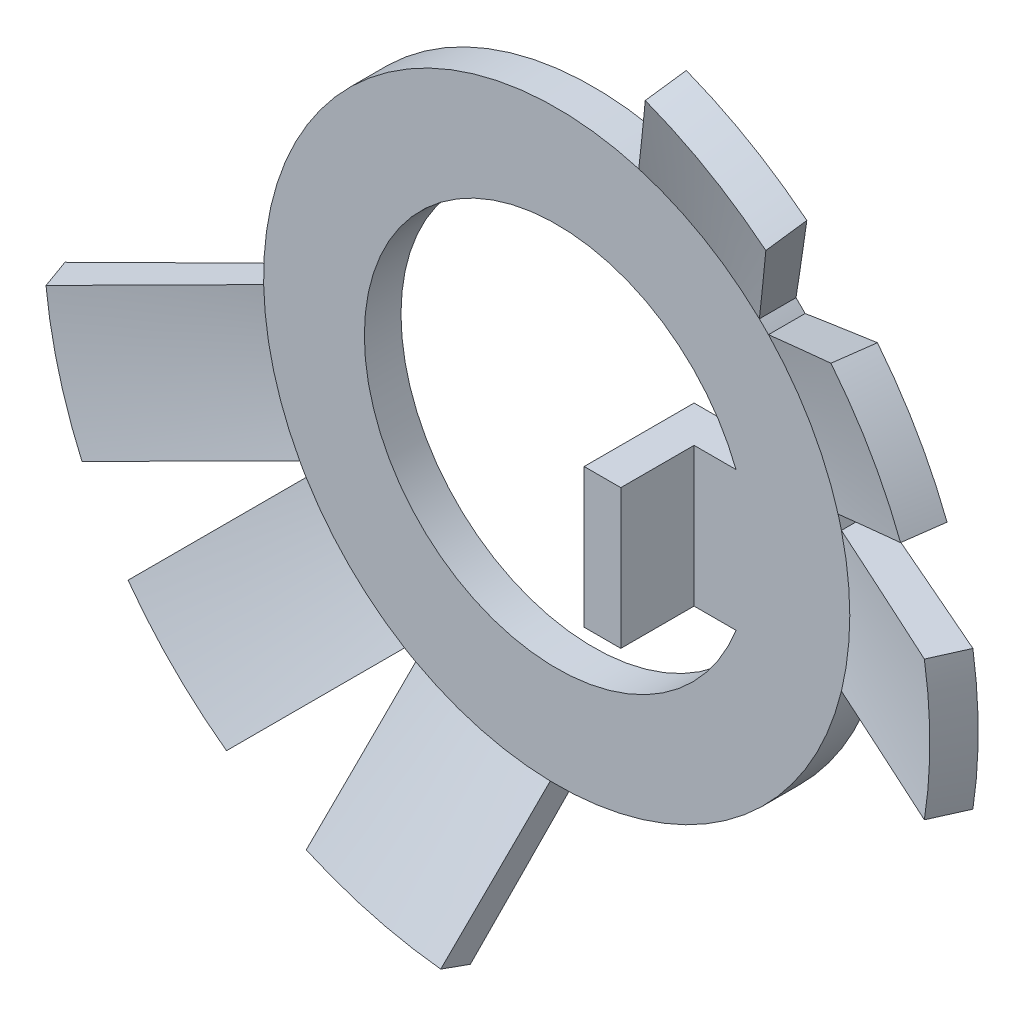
ISO-10303-21;
HEADER;
FILE_DESCRIPTION(('STEP AP214'),'2;1');
FILE_NAME('part.step','',(''),(''),'','','');
FILE_SCHEMA(('AUTOMOTIVE_DESIGN { 1 0 10303 214 1 1 1 1 }'));
ENDSEC;
DATA;
#1=APPLICATION_CONTEXT('core data for automotive mechanical design processes');
#2=APPLICATION_PROTOCOL_DEFINITION('international standard','automotive_design',2000,#1);
#3=PRODUCT_CONTEXT('',#1,'mechanical');
#4=PRODUCT('Part','Part','',(#3));
#5=PRODUCT_RELATED_PRODUCT_CATEGORY('part','',(#4));
#6=PRODUCT_DEFINITION_FORMATION('','',#4);
#7=PRODUCT_DEFINITION_CONTEXT('part definition',#1,'design');
#8=PRODUCT_DEFINITION('design','',#6,#7);
#9=PRODUCT_DEFINITION_SHAPE('','',#8);
#10=(LENGTH_UNIT() NAMED_UNIT(*) SI_UNIT(.MILLI.,.METRE.));
#11=(NAMED_UNIT(*) PLANE_ANGLE_UNIT() SI_UNIT($,.RADIAN.));
#12=(NAMED_UNIT(*) SI_UNIT($,.STERADIAN.) SOLID_ANGLE_UNIT());
#13=UNCERTAINTY_MEASURE_WITH_UNIT(LENGTH_MEASURE(1.E-05),#10,'distance_accuracy_value','');
#14=(GEOMETRIC_REPRESENTATION_CONTEXT(3) GLOBAL_UNCERTAINTY_ASSIGNED_CONTEXT((#13)) GLOBAL_UNIT_ASSIGNED_CONTEXT((#10,
#11,#12)) REPRESENTATION_CONTEXT('',''));
#15=CARTESIAN_POINT('',(0.,0.,0.));
#16=DIRECTION('',(0.,0.,1.));
#17=DIRECTION('',(1.,0.,0.));
#18=AXIS2_PLACEMENT_3D('',#15,#16,#17);
#19=CARTESIAN_POINT('',(0.,-8.,-1.90937831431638));
#20=DIRECTION('',(0.,0.,1.));
#21=DIRECTION('',(1.,0.,0.));
#22=AXIS2_PLACEMENT_3D('',#19,#20,#21);
#23=PLANE('',#22);
#24=CARTESIAN_POINT('',(0.,0.,-1.90937831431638));
#25=DIRECTION('',(0.,0.,1.));
#26=DIRECTION('',(1.,0.,0.));
#27=AXIS2_PLACEMENT_3D('',#24,#25,#26);
#28=CIRCLE('',#27,8.);
#29=CARTESIAN_POINT('',(7.77110030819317,1.9,-1.90937831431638));
#30=VERTEX_POINT('',#29);
#31=CARTESIAN_POINT('',(7.67997028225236,2.24010188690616,-1.90937831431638));
#32=VERTEX_POINT('',#31);
#33=EDGE_CURVE('E729',#30,#32,#28,.T.);
#34=ORIENTED_EDGE('',*,*,#33,.T.);
#35=CARTESIAN_POINT('',(5.77997028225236,5.53099842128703,-1.90937831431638));
#36=VERTEX_POINT('',#35);
#37=EDGE_CURVE('E1121',#32,#36,#28,.T.);
#38=ORIENTED_EDGE('',*,*,#37,.T.);
#39=CARTESIAN_POINT('',(5.53099842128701,5.77997028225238,-1.90937831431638));
#40=VERTEX_POINT('',#39);
#41=EDGE_CURVE('E1107',#36,#40,#28,.T.);
#42=ORIENTED_EDGE('',*,*,#41,.T.);
#43=CARTESIAN_POINT('',(2.24010188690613,7.67997028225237,-1.90937831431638));
#44=VERTEX_POINT('',#43);
#45=EDGE_CURVE('E1112',#40,#44,#28,.T.);
#46=ORIENTED_EDGE('',*,*,#45,.T.);
#47=CARTESIAN_POINT('',(-7.99806267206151,-0.176049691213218,-1.90937831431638));
#48=VERTEX_POINT('',#47);
#49=EDGE_CURVE('E1113',#44,#48,#28,.T.);
#50=ORIENTED_EDGE('',*,*,#49,.T.);
#51=CARTESIAN_POINT('',(-7.01455030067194,-3.84656783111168,-1.90937831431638));
#52=VERTEX_POINT('',#51);
#53=EDGE_CURVE('E1117',#48,#52,#28,.T.);
#54=ORIENTED_EDGE('',*,*,#53,.T.);
#55=CARTESIAN_POINT('',(-6.8385006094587,-4.15149484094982,-1.90937831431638));
#56=VERTEX_POINT('',#55);
#57=EDGE_CURVE('E1120',#52,#56,#28,.T.);
#58=ORIENTED_EDGE('',*,*,#57,.T.);
#59=CARTESIAN_POINT('',(-4.15149484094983,-6.8385006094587,-1.90937831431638));
#60=VERTEX_POINT('',#59);
#61=EDGE_CURVE('E1119',#56,#60,#28,.T.);
#62=ORIENTED_EDGE('',*,*,#61,.T.);
#63=CARTESIAN_POINT('',(-3.84656783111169,-7.01455030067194,-1.90937831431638));
#64=VERTEX_POINT('',#63);
#65=EDGE_CURVE('E1118',#60,#64,#28,.T.);
#66=ORIENTED_EDGE('',*,*,#65,.T.);
#67=CARTESIAN_POINT('',(-0.176049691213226,-7.99806267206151,-1.90937831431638));
#68=VERTEX_POINT('',#67);
#69=EDGE_CURVE('E719',#64,#68,#28,.T.);
#70=ORIENTED_EDGE('',*,*,#69,.T.);
#71=CARTESIAN_POINT('',(7.77110030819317,-1.9,-1.90937831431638));
#72=VERTEX_POINT('',#71);
#73=EDGE_CURVE('E1104',#68,#72,#28,.T.);
#74=ORIENTED_EDGE('',*,*,#73,.T.);
#75=EDGE_CURVE('E1123',#72,#30,#28,.T.);
#76=ORIENTED_EDGE('',*,*,#75,.T.);
#77=EDGE_LOOP('',(#34,#38,#42,#46,#50,#54,#58,#62,#66,#70,#74,#76));
#78=FACE_BOUND('',#77,.T.);
#79=DIRECTION('',(1.,0.,0.));
#80=VECTOR('',#79,1.);
#81=CARTESIAN_POINT('',(0.,1.9,-1.90937831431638));
#82=LINE('',#81,#80);
#83=CARTESIAN_POINT('',(3.75000000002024,1.9,-1.90937831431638));
#84=VERTEX_POINT('',#83);
#85=CARTESIAN_POINT('',(4.89412913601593,1.9,-1.90937831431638));
#86=VERTEX_POINT('',#85);
#87=EDGE_CURVE('E741',#84,#86,#82,.T.);
#88=ORIENTED_EDGE('',*,*,#87,.F.);
#89=DIRECTION('',(0.,-1.,0.));
#90=VECTOR('',#89,1.);
#91=CARTESIAN_POINT('',(3.75000000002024,-1.9,-1.90937831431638));
#92=LINE('',#91,#90);
#93=CARTESIAN_POINT('',(3.75000000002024,-1.9,-1.90937831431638));
#94=VERTEX_POINT('',#93);
#95=EDGE_CURVE('E54',#84,#94,#92,.T.);
#96=ORIENTED_EDGE('',*,*,#95,.T.);
#97=DIRECTION('',(-1.,0.,0.));
#98=VECTOR('',#97,1.);
#99=CARTESIAN_POINT('',(0.,-1.9,-1.90937831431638));
#100=LINE('',#99,#98);
#101=CARTESIAN_POINT('',(4.89412913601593,-1.9,-1.90937831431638));
#102=VERTEX_POINT('',#101);
#103=EDGE_CURVE('E48',#102,#94,#100,.T.);
#104=ORIENTED_EDGE('',*,*,#103,.F.);
#105=CARTESIAN_POINT('',(0.,0.,-1.90937831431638));
#106=DIRECTION('',(0.,0.,1.));
#107=DIRECTION('',(1.,0.,0.));
#108=AXIS2_PLACEMENT_3D('',#105,#106,#107);
#109=CIRCLE('',#108,5.25);
#110=EDGE_CURVE('E12',#86,#102,#109,.T.);
#111=ORIENTED_EDGE('',*,*,#110,.F.);
#112=EDGE_LOOP('',(#88,#96,#104,#111));
#113=FACE_BOUND('',#112,.T.);
#114=ADVANCED_FACE('F37',(#78,#113),#23,.T.);
#115=CARTESIAN_POINT('',(0.,0.,-0.914172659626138));
#116=DIRECTION('',(0.,0.,1.));
#117=DIRECTION('',(1.,0.,0.));
#118=AXIS2_PLACEMENT_3D('',#115,#116,#117);
#119=CONICAL_SURFACE('',#118,12.5,1.1534620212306);
#120=CARTESIAN_POINT('',(0.,0.,-0.914172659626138));
#121=DIRECTION('',(0.,0.,1.));
#122=DIRECTION('',(1.,0.,0.));
#123=AXIS2_PLACEMENT_3D('',#120,#121,#122);
#124=CIRCLE('',#123,12.5);
#125=CARTESIAN_POINT('',(12.3547561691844,-1.9,-0.914172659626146));
#126=VERTEX_POINT('',#125);
#127=CARTESIAN_POINT('',(12.3547561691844,1.9,-0.914172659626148));
#128=VERTEX_POINT('',#127);
#129=EDGE_CURVE('E735',#126,#128,#124,.T.);
#130=ORIENTED_EDGE('',*,*,#129,.F.);
#131=CARTESIAN_POINT('',(17.601383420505,-1.9,1.39301007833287));
#132=CARTESIAN_POINT('',(16.8382493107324,-1.9,1.05663912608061));
#133=CARTESIAN_POINT('',(16.0750447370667,-1.9,0.720427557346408));
#134=CARTESIAN_POINT('',(14.5483720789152,-1.9,0.0486671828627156));
#135=CARTESIAN_POINT('',(13.784904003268,-1.9,-0.286881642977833));
#136=CARTESIAN_POINT('',(12.2576636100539,-1.9,-0.956936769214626));
#137=CARTESIAN_POINT('',(11.4938913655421,-1.9,-1.29144323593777));
#138=CARTESIAN_POINT('',(10.3476385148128,-1.9,-1.79187594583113));
#139=CARTESIAN_POINT('',(9.96544884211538,-1.9,-1.95846842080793));
#140=CARTESIAN_POINT('',(9.20079765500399,-1.9,-2.29102816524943));
#141=CARTESIAN_POINT('',(8.81833614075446,-1.9,-2.45699543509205));
#142=CARTESIAN_POINT('',(8.18786763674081,-1.9,-2.72969877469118));
#143=CARTESIAN_POINT('',(7.93997428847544,-1.9,-2.83669751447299));
#144=CARTESIAN_POINT('',(7.44397471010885,-1.9,-3.0501971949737));
#145=CARTESIAN_POINT('',(7.19586848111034,-1.9,-3.15669813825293));
#146=CARTESIAN_POINT('',(6.69939112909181,-1.9,-3.36902929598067));
#147=CARTESIAN_POINT('',(6.45102002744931,-1.9,-3.47485956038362));
#148=CARTESIAN_POINT('',(5.95388721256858,-1.9,-3.68561247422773));
#149=CARTESIAN_POINT('',(5.70512549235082,-1.9,-3.7905351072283));
#150=CARTESIAN_POINT('',(5.20699904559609,-1.9,-3.99910968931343));
#151=CARTESIAN_POINT('',(4.95763418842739,-1.9,-4.10276132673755));
#152=CARTESIAN_POINT('',(4.45812622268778,-1.9,-4.3081457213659));
#153=CARTESIAN_POINT('',(4.2079831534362,-1.9,-4.40987857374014));
#154=CARTESIAN_POINT('',(3.8318262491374,-1.9,-4.56022064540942));
#155=CARTESIAN_POINT('',(3.70626660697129,-1.9,-4.60996500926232));
#156=CARTESIAN_POINT('',(3.45476338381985,-1.9,-4.70846706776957));
#157=CARTESIAN_POINT('',(3.32881981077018,-1.9,-4.75722478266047));
#158=CARTESIAN_POINT('',(3.07642309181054,-1.9,-4.85347506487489));
#159=CARTESIAN_POINT('',(2.94996986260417,-1.9,-4.90096741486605));
#160=CARTESIAN_POINT('',(2.69641550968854,-1.9,-4.9942150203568));
#161=CARTESIAN_POINT('',(2.56931434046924,-1.9,-5.0399701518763));
#162=CARTESIAN_POINT('',(2.44181834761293,-1.9,-5.084621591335));
#163=B_SPLINE_CURVE_WITH_KNOTS('',3,(#131,#132,#133,#134,#135,#136,#137,#138,#139,#140,#141,
#142,#143,#144,#145,#146,#147,#148,#149,#150,#151,#152,#153,#154,#155,#156,#157,#158,#159,#160,
#161,#162),.UNSPECIFIED.,.F.,.F.,(4,2,2,2,2,2,2,2,2,2,2,2,2,2,2,4),(0.,2.50193384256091,
5.00379063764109,7.50522536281,8.75598398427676,10.0067418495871,10.8167405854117,
11.6267351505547,12.436668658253,13.2466168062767,14.0567597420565,14.8668623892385,
15.2720227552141,15.6771748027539,16.0823959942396,16.4876460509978),.UNSPECIFIED.);
#164=CARTESIAN_POINT('',(7.77110030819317,-1.9,-2.90937831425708));
#165=VERTEX_POINT('',#164);
#166=EDGE_CURVE('E1093',#126,#165,#163,.T.);
#167=ORIENTED_EDGE('',*,*,#166,.T.);
#168=CARTESIAN_POINT('',(0.,0.,-2.90937831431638));
#169=DIRECTION('',(0.,0.,1.));
#170=DIRECTION('',(1.,0.,0.));
#171=AXIS2_PLACEMENT_3D('',#168,#169,#170);
#172=CIRCLE('',#171,8.);
#173=CARTESIAN_POINT('',(7.77110030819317,1.9,-2.90937831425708));
#174=VERTEX_POINT('',#173);
#175=EDGE_CURVE('E743',#165,#174,#172,.T.);
#176=ORIENTED_EDGE('',*,*,#175,.T.);
#177=CARTESIAN_POINT('',(2.44181834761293,1.9,-5.084621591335));
#178=CARTESIAN_POINT('',(2.56910042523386,1.9,-5.04004523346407));
#179=CARTESIAN_POINT('',(2.69598895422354,1.9,-4.99436868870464));
#180=CARTESIAN_POINT('',(2.94911995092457,1.9,-4.90128325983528));
#181=CARTESIAN_POINT('',(3.07536246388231,1.9,-4.85387449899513));
#182=CARTESIAN_POINT('',(3.32733900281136,1.9,-4.75779440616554));
#183=CARTESIAN_POINT('',(3.4530731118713,1.9,-4.70912329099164));
#184=CARTESIAN_POINT('',(3.70415822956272,1.9,-4.61079644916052));
#185=CARTESIAN_POINT('',(3.82950923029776,1.9,-4.56114070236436));
#186=CARTESIAN_POINT('',(4.20504147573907,1.9,-4.41106625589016));
#187=CARTESIAN_POINT('',(4.45476936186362,1.9,-4.30951435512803));
#188=CARTESIAN_POINT('',(4.95344790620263,1.9,-4.10449394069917));
#189=CARTESIAN_POINT('',(5.20239852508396,1.9,-4.00102533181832));
#190=CARTESIAN_POINT('',(5.70052473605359,1.9,-3.79247201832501));
#191=CARTESIAN_POINT('',(5.94969865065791,1.9,-3.68738331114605));
#192=CARTESIAN_POINT('',(6.44765302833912,1.9,-3.47629170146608));
#193=CARTESIAN_POINT('',(6.69643349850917,1.9,-3.37028881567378));
#194=CARTESIAN_POINT('',(7.4424232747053,1.9,-3.05126343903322));
#195=CARTESIAN_POINT('',(7.93921023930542,1.9,-2.83725402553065));
#196=CARTESIAN_POINT('',(9.2012185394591,1.9,-2.29138197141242));
#197=CARTESIAN_POINT('',(9.96600135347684,1.9,-1.95850768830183));
#198=CARTESIAN_POINT('',(11.4948098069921,1.9,-1.29102620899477));
#199=CARTESIAN_POINT('',(12.2588354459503,1.9,-0.956419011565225));
#200=CARTESIAN_POINT('',(13.7861044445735,1.9,-0.286358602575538));
#201=CARTESIAN_POINT('',(14.5493480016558,1.9,0.0490941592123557));
#202=CARTESIAN_POINT('',(16.0755448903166,1.9,0.720650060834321));
#203=CARTESIAN_POINT('',(16.8384982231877,1.9,1.05675319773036));
#204=CARTESIAN_POINT('',(17.601383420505,1.9,1.39301007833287));
#205=B_SPLINE_CURVE_WITH_KNOTS('',3,(#177,#178,#179,#180,#181,#182,#183,#184,#185,#186,#187,
#188,#189,#190,#191,#192,#193,#194,#195,#196,#197,#198,#199,#200,#201,#202,#203,#204),
.UNSPECIFIED.,.F.,.F.,(4,2,2,2,2,2,2,2,2,2,2,2,2,4),(0.,0.404570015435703,0.809111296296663,
1.21358354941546,1.61806408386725,2.42680845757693,3.23559311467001,4.04687423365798,
4.85814055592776,6.48090338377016,8.98315454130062,11.4854074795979,13.9865315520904,
16.4876443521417),.UNSPECIFIED.);
#206=EDGE_CURVE('E452',#174,#128,#205,.T.);
#207=ORIENTED_EDGE('',*,*,#206,.T.);
#208=EDGE_LOOP('',(#130,#167,#176,#207));
#209=FACE_BOUND('',#208,.T.);
#210=ADVANCED_FACE('F355',(#209),#119,.T.);
#211=CARTESIAN_POINT('',(11.6495327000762,4.53192981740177,-0.914172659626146));
#212=VERTEX_POINT('',#211);
#213=CARTESIAN_POINT('',(9.74953270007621,7.82282635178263,-0.914172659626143));
#214=VERTEX_POINT('',#213);
#215=EDGE_CURVE('E736',#212,#214,#124,.T.);
#216=ORIENTED_EDGE('',*,*,#215,.F.);
#217=CARTESIAN_POINT('',(11.6497327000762,4.53204528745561,-0.91407145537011));
#218=CARTESIAN_POINT('',(11.3192560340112,4.34124449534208,-1.08129193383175));
#219=CARTESIAN_POINT('',(10.9887272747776,4.15041362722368,-1.24837540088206));
#220=CARTESIAN_POINT('',(10.3275176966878,3.76866409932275,-1.58213822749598));
#221=CARTESIAN_POINT('',(9.99683687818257,3.57774543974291,-1.74881758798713));
#222=CARTESIAN_POINT('',(9.33527333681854,3.19579155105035,-2.08164311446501));
#223=CARTESIAN_POINT('',(9.0043906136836,3.0047563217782,-2.24778927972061));
#224=CARTESIAN_POINT('',(8.34232743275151,2.62251396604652,-2.57929099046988));
#225=CARTESIAN_POINT('',(8.01114697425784,2.43130683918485,-2.74464653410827));
#226=CARTESIAN_POINT('',(7.67977028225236,2.23998641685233,-2.90947777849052));
#227=B_SPLINE_CURVE_WITH_KNOTS('',3,(#217,#218,#219,#220,#221,#222,#223,#224,#225,#226),
.UNSPECIFIED.,.F.,.F.,(4,2,2,2,4),(0.,1.24989694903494,2.49979102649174,3.74968681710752,
4.99958553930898),.UNSPECIFIED.);
#228=CARTESIAN_POINT('',(7.67997028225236,2.24010188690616,-2.90937831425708));
#229=VERTEX_POINT('',#228);
#230=EDGE_CURVE('E443',#212,#229,#227,.T.);
#231=ORIENTED_EDGE('',*,*,#230,.T.);
#232=CARTESIAN_POINT('',(5.77997028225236,5.53099842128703,-2.90937831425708));
#233=VERTEX_POINT('',#232);
#234=EDGE_CURVE('E745',#229,#233,#172,.T.);
#235=ORIENTED_EDGE('',*,*,#234,.T.);
#236=CARTESIAN_POINT('',(5.77977028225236,5.53088295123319,-2.90947777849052));
#237=CARTESIAN_POINT('',(6.11114697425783,5.72220337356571,-2.74464653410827));
#238=CARTESIAN_POINT('',(6.4423274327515,5.91341050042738,-2.57929099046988));
#239=CARTESIAN_POINT('',(7.1043906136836,6.29565285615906,-2.24778927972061));
#240=CARTESIAN_POINT('',(7.43527333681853,6.48668808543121,-2.08164311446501));
#241=CARTESIAN_POINT('',(8.09683687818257,6.86864197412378,-1.74881758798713));
#242=CARTESIAN_POINT('',(8.42751769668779,7.05956063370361,-1.58213822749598));
#243=CARTESIAN_POINT('',(9.08872727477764,7.44131016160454,-1.24837540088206));
#244=CARTESIAN_POINT('',(9.41925603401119,7.63214102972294,-1.08129193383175));
#245=CARTESIAN_POINT('',(9.74973270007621,7.82294182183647,-0.914071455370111));
#246=B_SPLINE_CURVE_WITH_KNOTS('',3,(#236,#237,#238,#239,#240,#241,#242,#243,#244,#245),
.UNSPECIFIED.,.F.,.F.,(4,2,2,2,4),(0.,1.24989872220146,2.49979451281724,3.74968859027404,
4.99958553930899),.UNSPECIFIED.);
#247=EDGE_CURVE('E434',#233,#214,#246,.T.);
#248=ORIENTED_EDGE('',*,*,#247,.T.);
#249=EDGE_LOOP('',(#216,#231,#235,#248));
#250=FACE_BOUND('',#249,.T.);
#251=ADVANCED_FACE('F358',(#250),#119,.T.);
#252=CARTESIAN_POINT('',(7.82282635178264,9.74953270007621,-0.914172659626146));
#253=VERTEX_POINT('',#252);
#254=CARTESIAN_POINT('',(4.53192981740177,11.6495327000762,-0.914172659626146));
#255=VERTEX_POINT('',#254);
#256=EDGE_CURVE('E1100',#253,#255,#124,.T.);
#257=ORIENTED_EDGE('',*,*,#256,.F.);
#258=CARTESIAN_POINT('',(7.82294182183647,9.74973270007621,-0.914071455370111));
#259=CARTESIAN_POINT('',(7.63214102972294,9.41925603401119,-1.08129193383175));
#260=CARTESIAN_POINT('',(7.44131016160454,9.08872727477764,-1.24837540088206));
#261=CARTESIAN_POINT('',(7.0595606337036,8.42751769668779,-1.58213822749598));
#262=CARTESIAN_POINT('',(6.86864197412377,8.09683687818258,-1.74881758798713));
#263=CARTESIAN_POINT('',(6.4866880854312,7.43527333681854,-2.08164311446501));
#264=CARTESIAN_POINT('',(6.29565285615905,7.10439061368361,-2.24778927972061));
#265=CARTESIAN_POINT('',(5.91341050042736,6.44232743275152,-2.57929099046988));
#266=CARTESIAN_POINT('',(5.7222033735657,6.11114697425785,-2.74464653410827));
#267=CARTESIAN_POINT('',(5.53088295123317,5.77977028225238,-2.90947777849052));
#268=B_SPLINE_CURVE_WITH_KNOTS('',3,(#258,#259,#260,#261,#262,#263,#264,#265,#266,#267),
.UNSPECIFIED.,.F.,.F.,(4,2,2,2,4),(0.,1.24989694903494,2.49979102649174,3.74968681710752,
4.99958553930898),.UNSPECIFIED.);
#269=CARTESIAN_POINT('',(5.53099842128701,5.77997028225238,-2.90937831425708));
#270=VERTEX_POINT('',#269);
#271=EDGE_CURVE('E424',#253,#270,#268,.T.);
#272=ORIENTED_EDGE('',*,*,#271,.T.);
#273=CARTESIAN_POINT('',(2.24010188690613,7.67997028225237,-2.90937831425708));
#274=VERTEX_POINT('',#273);
#275=EDGE_CURVE('E1101',#270,#274,#172,.T.);
#276=ORIENTED_EDGE('',*,*,#275,.T.);
#277=CARTESIAN_POINT('',(2.2399864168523,7.67977028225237,-2.90947777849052));
#278=CARTESIAN_POINT('',(2.43130683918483,8.01114697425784,-2.74464653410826));
#279=CARTESIAN_POINT('',(2.62251396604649,8.34232743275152,-2.57929099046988));
#280=CARTESIAN_POINT('',(3.00475632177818,9.00439061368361,-2.24778927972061));
#281=CARTESIAN_POINT('',(3.19579155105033,9.33527333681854,-2.08164311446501));
#282=CARTESIAN_POINT('',(3.5777454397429,9.99683687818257,-1.74881758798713));
#283=CARTESIAN_POINT('',(3.76866409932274,10.3275176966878,-1.58213822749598));
#284=CARTESIAN_POINT('',(4.15041362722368,10.9887272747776,-1.24837540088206));
#285=CARTESIAN_POINT('',(4.34124449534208,11.3192560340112,-1.08129193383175));
#286=CARTESIAN_POINT('',(4.53204528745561,11.6497327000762,-0.914071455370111));
#287=B_SPLINE_CURVE_WITH_KNOTS('',3,(#277,#278,#279,#280,#281,#282,#283,#284,#285,#286),
.UNSPECIFIED.,.F.,.F.,(4,2,2,2,4),(0.,1.24989872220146,2.49979451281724,3.74968859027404,
4.99958553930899),.UNSPECIFIED.);
#288=EDGE_CURVE('E414',#274,#255,#287,.T.);
#289=ORIENTED_EDGE('',*,*,#288,.T.);
#290=EDGE_LOOP('',(#257,#272,#276,#289));
#291=FACE_BOUND('',#290,.T.);
#292=ADVANCED_FACE('F937',(#291),#119,.T.);
#293=CARTESIAN_POINT('',(-12.4255342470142,-1.36238712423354,-0.914172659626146));
#294=VERTEX_POINT('',#293);
#295=CARTESIAN_POINT('',(-11.4420218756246,-5.032905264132,-0.914172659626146));
#296=VERTEX_POINT('',#295);
#297=EDGE_CURVE('E1099',#294,#296,#124,.T.);
#298=ORIENTED_EDGE('',*,*,#297,.F.);
#299=CARTESIAN_POINT('',(-12.4257342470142,-1.36244071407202,-0.914081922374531));
#300=CARTESIAN_POINT('',(-12.0571392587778,-1.26367598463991,-1.08130065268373));
#301=CARTESIAN_POINT('',(-11.688486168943,-1.16489568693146,-1.24838237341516));
#302=CARTESIAN_POINT('',(-10.9510103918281,-0.967289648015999,-1.58214171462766));
#303=CARTESIAN_POINT('',(-10.5821877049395,-0.868463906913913,-1.74881933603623));
#304=CARTESIAN_POINT('',(-9.84431714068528,-0.670752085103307,-2.08164139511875));
#305=CARTESIAN_POINT('',(-9.47526926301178,-0.571866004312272,-2.24778583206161));
#306=CARTESIAN_POINT('',(-8.73684143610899,-0.374004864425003,-2.5792841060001));
#307=CARTESIAN_POINT('',(-8.3674614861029,-0.275029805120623,-2.74463794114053));
#308=CARTESIAN_POINT('',(-7.99786267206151,-0.175996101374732,-2.909467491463));
#309=B_SPLINE_CURVE_WITH_KNOTS('',3,(#299,#300,#301,#302,#303,#304,#305,#306,#307,#308),
.UNSPECIFIED.,.F.,.F.,(4,2,2,2,4),(0.,1.24988392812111,2.49976498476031,3.74964775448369,
4.99953345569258),.UNSPECIFIED.);
#310=CARTESIAN_POINT('',(-7.99806267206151,-0.176049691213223,-2.90937831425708));
#311=VERTEX_POINT('',#310);
#312=EDGE_CURVE('E403',#294,#311,#309,.T.);
#313=ORIENTED_EDGE('',*,*,#312,.T.);
#314=CARTESIAN_POINT('',(-7.01455030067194,-3.84656783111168,-2.90937831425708));
#315=VERTEX_POINT('',#314);
#316=EDGE_CURVE('E1105',#311,#315,#172,.T.);
#317=ORIENTED_EDGE('',*,*,#316,.T.);
#318=CARTESIAN_POINT('',(-7.01435030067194,-3.84651424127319,-2.909467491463));
#319=CARTESIAN_POINT('',(-7.38394911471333,-3.94554794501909,-2.74463794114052));
#320=CARTESIAN_POINT('',(-7.75332906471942,-4.04452300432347,-2.57928410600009));
#321=CARTESIAN_POINT('',(-8.49175689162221,-4.24238414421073,-2.24778583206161));
#322=CARTESIAN_POINT('',(-8.86080476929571,-4.34127022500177,-2.08164139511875));
#323=CARTESIAN_POINT('',(-9.5986753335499,-4.53898204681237,-1.74881933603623));
#324=CARTESIAN_POINT('',(-9.96749802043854,-4.63780778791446,-1.58214171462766));
#325=CARTESIAN_POINT('',(-10.7049737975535,-4.83541382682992,-1.24838237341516));
#326=CARTESIAN_POINT('',(-11.0736268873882,-4.93419412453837,-1.08130065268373));
#327=CARTESIAN_POINT('',(-11.4422218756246,-5.03295885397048,-0.914081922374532));
#328=B_SPLINE_CURVE_WITH_KNOTS('',3,(#318,#319,#320,#321,#322,#323,#324,#325,#326,#327),
.UNSPECIFIED.,.F.,.F.,(4,2,2,2,4),(0.,1.24988570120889,2.49976847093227,3.74964952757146,
4.99953345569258),.UNSPECIFIED.);
#329=EDGE_CURVE('E394',#315,#296,#328,.T.);
#330=ORIENTED_EDGE('',*,*,#329,.T.);
#331=EDGE_LOOP('',(#298,#313,#317,#330));
#332=FACE_BOUND('',#331,.T.);
#333=ADVANCED_FACE('F946',(#332),#119,.T.);
#334=CARTESIAN_POINT('',(-10.0796347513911,-7.39262898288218,-0.914172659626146));
#335=VERTEX_POINT('',#334);
#336=CARTESIAN_POINT('',(-7.39262898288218,-10.0796347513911,-0.914172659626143));
#337=VERTEX_POINT('',#336);
#338=EDGE_CURVE('E1096',#335,#337,#124,.T.);
#339=ORIENTED_EDGE('',*,*,#338,.F.);
#340=CARTESIAN_POINT('',(-10.0798347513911,-7.39282898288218,-0.914048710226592));
#341=CARTESIAN_POINT('',(-9.80999557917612,-7.12298981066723,-1.08127298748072));
#342=CARTESIAN_POINT('',(-9.54011387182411,-6.85310810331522,-1.24836024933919));
#343=CARTESIAN_POINT('',(-9.00022629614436,-6.31322052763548,-1.58213064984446));
#344=CARTESIAN_POINT('',(-8.73022042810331,-6.04321465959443,-1.74881378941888));
#345=CARTESIAN_POINT('',(-8.19004383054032,-5.50303806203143,-2.08164685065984));
#346=CARTESIAN_POINT('',(-7.9198731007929,-5.23286733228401,-2.24779677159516));
#347=CARTESIAN_POINT('',(-7.37928852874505,-4.69228276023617,-2.57930595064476));
#348=CARTESIAN_POINT('',(-7.10887468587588,-4.42186891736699,-2.74466520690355));
#349=CARTESIAN_POINT('',(-6.8383006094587,-4.15129484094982,-2.9095001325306));
#350=B_SPLINE_CURVE_WITH_KNOTS('',3,(#340,#341,#342,#343,#344,#345,#346,#347,#348,#349),
.UNSPECIFIED.,.F.,.F.,(4,2,2,2,4),(0.,1.24992524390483,2.4998476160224,3.74977170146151,
4.99969871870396),.UNSPECIFIED.);
#351=CARTESIAN_POINT('',(-6.8385006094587,-4.15149484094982,-2.90937831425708));
#352=VERTEX_POINT('',#351);
#353=EDGE_CURVE('E383',#335,#352,#350,.T.);
#354=ORIENTED_EDGE('',*,*,#353,.T.);
#355=CARTESIAN_POINT('',(-4.15149484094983,-6.8385006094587,-2.90937831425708));
#356=VERTEX_POINT('',#355);
#357=EDGE_CURVE('E1097',#352,#356,#172,.T.);
#358=ORIENTED_EDGE('',*,*,#357,.T.);
#359=CARTESIAN_POINT('',(-4.15129484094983,-6.8383006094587,-2.9095001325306));
#360=CARTESIAN_POINT('',(-4.421868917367,-7.10887468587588,-2.74466520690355));
#361=CARTESIAN_POINT('',(-4.69228276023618,-7.37928852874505,-2.57930595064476));
#362=CARTESIAN_POINT('',(-5.23286733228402,-7.91987310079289,-2.24779677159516));
#363=CARTESIAN_POINT('',(-5.50303806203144,-8.19004383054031,-2.08164685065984));
#364=CARTESIAN_POINT('',(-6.04321465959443,-8.7302204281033,-1.74881378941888));
#365=CARTESIAN_POINT('',(-6.31322052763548,-9.00022629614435,-1.58213064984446));
#366=CARTESIAN_POINT('',(-6.85310810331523,-9.5401138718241,-1.24836024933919));
#367=CARTESIAN_POINT('',(-7.12298981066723,-9.8099955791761,-1.08127298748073));
#368=CARTESIAN_POINT('',(-7.39282898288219,-10.0798347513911,-0.914048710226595));
#369=B_SPLINE_CURVE_WITH_KNOTS('',3,(#359,#360,#361,#362,#363,#364,#365,#366,#367,#368),
.UNSPECIFIED.,.F.,.F.,(4,2,2,2,4),(0.,1.24992701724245,2.49985110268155,3.74977347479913,
4.99969871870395),.UNSPECIFIED.);
#370=EDGE_CURVE('E374',#356,#337,#369,.T.);
#371=ORIENTED_EDGE('',*,*,#370,.T.);
#372=EDGE_LOOP('',(#339,#354,#358,#371));
#373=FACE_BOUND('',#372,.T.);
#374=ADVANCED_FACE('F954',(#373),#119,.T.);
#375=CARTESIAN_POINT('',(-5.03290526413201,-11.4420218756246,-0.914172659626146));
#376=VERTEX_POINT('',#375);
#377=CARTESIAN_POINT('',(-1.36238712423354,-12.4255342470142,-0.914172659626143));
#378=VERTEX_POINT('',#377);
#379=EDGE_CURVE('E740',#376,#378,#124,.T.);
#380=ORIENTED_EDGE('',*,*,#379,.F.);
#381=CARTESIAN_POINT('',(-5.03295885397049,-11.4422218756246,-0.914081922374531));
#382=CARTESIAN_POINT('',(-4.93419412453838,-11.0736268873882,-1.08130065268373));
#383=CARTESIAN_POINT('',(-4.83541382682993,-10.7049737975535,-1.24838237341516));
#384=CARTESIAN_POINT('',(-4.63780778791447,-9.96749802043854,-1.58214171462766));
#385=CARTESIAN_POINT('',(-4.53898204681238,-9.5986753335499,-1.74881933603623));
#386=CARTESIAN_POINT('',(-4.34127022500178,-8.86080476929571,-2.08164139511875));
#387=CARTESIAN_POINT('',(-4.24238414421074,-8.4917568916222,-2.24778583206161));
#388=CARTESIAN_POINT('',(-4.04452300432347,-7.75332906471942,-2.57928410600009));
#389=CARTESIAN_POINT('',(-3.94554794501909,-7.38394911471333,-2.74463794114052));
#390=CARTESIAN_POINT('',(-3.8465142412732,-7.01435030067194,-2.909467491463));
#391=B_SPLINE_CURVE_WITH_KNOTS('',3,(#381,#382,#383,#384,#385,#386,#387,#388,#389,#390),
.UNSPECIFIED.,.F.,.F.,(4,2,2,2,4),(0.,1.24988392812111,2.49976498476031,3.74964775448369,
4.99953345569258),.UNSPECIFIED.);
#392=CARTESIAN_POINT('',(-3.84656783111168,-7.01455030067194,-2.90937831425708));
#393=VERTEX_POINT('',#392);
#394=EDGE_CURVE('E370',#376,#393,#391,.T.);
#395=ORIENTED_EDGE('',*,*,#394,.T.);
#396=CARTESIAN_POINT('',(-0.176049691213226,-7.99806267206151,-2.90937831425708));
#397=VERTEX_POINT('',#396);
#398=EDGE_CURVE('E1094',#393,#397,#172,.T.);
#399=ORIENTED_EDGE('',*,*,#398,.T.);
#400=CARTESIAN_POINT('',(-0.175996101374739,-7.99786267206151,-2.909467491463));
#401=CARTESIAN_POINT('',(-0.27502980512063,-8.36746148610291,-2.74463794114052));
#402=CARTESIAN_POINT('',(-0.374004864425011,-8.736841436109,-2.57928410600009));
#403=CARTESIAN_POINT('',(-0.57186600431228,-9.47526926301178,-2.24778583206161));
#404=CARTESIAN_POINT('',(-0.670752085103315,-9.84431714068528,-2.08164139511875));
#405=CARTESIAN_POINT('',(-0.868463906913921,-10.5821877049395,-1.74881933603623));
#406=CARTESIAN_POINT('',(-0.967289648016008,-10.9510103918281,-1.58214171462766));
#407=CARTESIAN_POINT('',(-1.16489568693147,-11.688486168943,-1.24838237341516));
#408=CARTESIAN_POINT('',(-1.26367598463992,-12.0571392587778,-1.08130065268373));
#409=CARTESIAN_POINT('',(-1.36244071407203,-12.4257342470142,-0.914081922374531));
#410=B_SPLINE_CURVE_WITH_KNOTS('',3,(#400,#401,#402,#403,#404,#405,#406,#407,#408,#409),
.UNSPECIFIED.,.F.,.F.,(4,2,2,2,4),(0.,1.24988570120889,2.49976847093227,3.74964952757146,
4.99953345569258),.UNSPECIFIED.);
#411=EDGE_CURVE('E338',#397,#378,#410,.T.);
#412=ORIENTED_EDGE('',*,*,#411,.T.);
#413=EDGE_LOOP('',(#380,#395,#399,#412));
#414=FACE_BOUND('',#413,.T.);
#415=ADVANCED_FACE('F356',(#414),#119,.T.);
#416=CARTESIAN_POINT('',(0.,0.,0.));
#417=DIRECTION('',(0.,0.,-1.));
#418=DIRECTION('',(-1.,0.,0.));
#419=AXIS2_PLACEMENT_3D('',#416,#417,#418);
#420=CONICAL_SURFACE('',#419,12.0946750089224,0.417334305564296);
#421=CARTESIAN_POINT('',(0.,0.,0.));
#422=DIRECTION('',(0.,0.,1.));
#423=DIRECTION('',(1.,0.,0.));
#424=AXIS2_PLACEMENT_3D('',#421,#422,#423);
#425=CIRCLE('',#424,12.0946750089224);
#426=CARTESIAN_POINT('',(11.944503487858,-1.9,0.));
#427=VERTEX_POINT('',#426);
#428=CARTESIAN_POINT('',(11.944503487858,1.9,0.));
#429=VERTEX_POINT('',#428);
#430=EDGE_CURVE('E727',#427,#429,#425,.T.);
#431=ORIENTED_EDGE('',*,*,#430,.F.);
#432=CARTESIAN_POINT('',(8.51292817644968,-1.9,7.60589211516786));
#433=CARTESIAN_POINT('',(8.81258694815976,-1.9,6.94622067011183));
#434=CARTESIAN_POINT('',(9.11166082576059,-1.9,6.28628400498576));
#435=CARTESIAN_POINT('',(9.70887568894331,-1.9,4.96598921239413));
#436=CARTESIAN_POINT('',(10.0070166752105,-1.9,4.30563108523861));
#437=CARTESIAN_POINT('',(10.6026024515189,-1.9,2.98460279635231));
#438=CARTESIAN_POINT('',(10.9000472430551,-1.9,2.32393263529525));
#439=CARTESIAN_POINT('',(11.4943873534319,-1.9,1.00234506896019));
#440=CARTESIAN_POINT('',(11.7912826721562,-1.9,0.341427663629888));
#441=CARTESIAN_POINT('',(12.6813195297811,-1.9,-1.64161288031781));
#442=CARTESIAN_POINT('',(13.2738130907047,-1.9,-2.96402683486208));
#443=CARTESIAN_POINT('',(14.1616962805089,-1.9,-4.94803288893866));
#444=CARTESIAN_POINT('',(14.4575148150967,-1.9,-5.60943316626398));
#445=CARTESIAN_POINT('',(15.0489092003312,-1.9,-6.93234209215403));
#446=CARTESIAN_POINT('',(15.344485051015,-1.9,-7.59385074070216));
#447=CARTESIAN_POINT('',(15.6399612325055,-1.9,-8.25540392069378));
#448=B_SPLINE_CURVE_WITH_KNOTS('',3,(#432,#433,#434,#435,#436,#437,#438,#439,#440,#441,#442,
#443,#444,#445,#446,#447),.UNSPECIFIED.,.F.,.F.,(4,2,2,2,2,2,2,4),(0.,2.17362651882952,
4.34725144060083,6.52087169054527,8.69449240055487,13.0417256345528,15.2153471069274,
17.3889682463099),.UNSPECIFIED.);
#449=EDGE_CURVE('E1141',#427,#126,#448,.T.);
#450=ORIENTED_EDGE('',*,*,#449,.T.);
#451=ORIENTED_EDGE('',*,*,#129,.T.);
#452=CARTESIAN_POINT('',(15.6399612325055,1.9,-8.25540392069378));
#453=CARTESIAN_POINT('',(15.344485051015,1.9,-7.59385074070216));
#454=CARTESIAN_POINT('',(15.0489092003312,1.9,-6.93234209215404));
#455=CARTESIAN_POINT('',(14.4575148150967,1.9,-5.60943316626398));
#456=CARTESIAN_POINT('',(14.1616962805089,1.9,-4.94803288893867));
#457=CARTESIAN_POINT('',(13.2738130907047,1.9,-2.96402683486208));
#458=CARTESIAN_POINT('',(12.6813195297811,1.9,-1.64161288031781));
#459=CARTESIAN_POINT('',(11.7912826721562,1.9,0.341427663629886));
#460=CARTESIAN_POINT('',(11.4943873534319,1.9,1.00234506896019));
#461=CARTESIAN_POINT('',(10.9000472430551,1.9,2.32393263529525));
#462=CARTESIAN_POINT('',(10.6026024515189,1.9,2.98460279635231));
#463=CARTESIAN_POINT('',(10.0070166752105,1.9,4.30563108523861));
#464=CARTESIAN_POINT('',(9.70887568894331,1.9,4.96598921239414));
#465=CARTESIAN_POINT('',(9.11166082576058,1.9,6.28628400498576));
#466=CARTESIAN_POINT('',(8.81258694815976,1.9,6.94622067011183));
#467=CARTESIAN_POINT('',(8.51292817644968,1.9,7.60589211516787));
#468=B_SPLINE_CURVE_WITH_KNOTS('',3,(#452,#453,#454,#455,#456,#457,#458,#459,#460,#461,#462,
#463,#464,#465,#466,#467),.UNSPECIFIED.,.F.,.F.,(4,2,2,2,2,2,2,4),(0.,2.17362113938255,
4.34724261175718,8.69447584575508,10.8680965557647,13.0417168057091,15.2153417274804,
17.3889682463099),.UNSPECIFIED.);
#469=EDGE_CURVE('E465',#128,#429,#468,.T.);
#470=ORIENTED_EDGE('',*,*,#469,.T.);
#471=EDGE_LOOP('',(#431,#450,#451,#470));
#472=FACE_BOUND('',#471,.T.);
#473=ADVANCED_FACE('F360',(#472),#420,.T.);
#474=CARTESIAN_POINT('',(11.2942434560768,4.32680347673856,0.));
#475=VERTEX_POINT('',#474);
#476=CARTESIAN_POINT('',(9.39424345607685,7.61770001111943,0.));
#477=VERTEX_POINT('',#476);
#478=EDGE_CURVE('E728',#475,#477,#425,.T.);
#479=ORIENTED_EDGE('',*,*,#478,.F.);
#480=CARTESIAN_POINT('',(11.2941656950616,4.32675858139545,0.000200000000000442));
#481=CARTESIAN_POINT('',(11.3534263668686,4.36097274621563,-0.152218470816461));
#482=CARTESIAN_POINT('',(11.4126770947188,4.39518116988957,-0.304642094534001));
#483=CARTESIAN_POINT('',(11.531158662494,4.46358653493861,-0.609499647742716));
#484=CARTESIAN_POINT('',(11.5903895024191,4.4977834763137,-0.761933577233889));
#485=CARTESIAN_POINT('',(11.6496103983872,4.53197467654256,-0.914372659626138));
#486=B_SPLINE_CURVE_WITH_KNOTS('',3,(#480,#481,#482,#483,#484,#485),.UNSPECIFIED.,.F.,.F.,(4,2,
4),(0.,0.501222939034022,1.00244587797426),.UNSPECIFIED.);
#487=EDGE_CURVE('E500',#475,#212,#486,.T.);
#488=ORIENTED_EDGE('',*,*,#487,.T.);
#489=ORIENTED_EDGE('',*,*,#215,.T.);
#490=CARTESIAN_POINT('',(9.74961039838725,7.82287121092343,-0.914372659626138));
#491=CARTESIAN_POINT('',(9.69038950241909,7.78868001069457,-0.761933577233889));
#492=CARTESIAN_POINT('',(9.63115866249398,7.75448306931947,-0.609499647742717));
#493=CARTESIAN_POINT('',(9.51267709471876,7.68607770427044,-0.304642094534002));
#494=CARTESIAN_POINT('',(9.45342636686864,7.65186928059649,-0.152218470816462));
#495=CARTESIAN_POINT('',(9.39416569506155,7.61765511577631,0.000200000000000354));
#496=B_SPLINE_CURVE_WITH_KNOTS('',3,(#490,#491,#492,#493,#494,#495),.UNSPECIFIED.,.F.,.F.,(4,2,
4),(0.,0.501222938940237,1.00244587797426),.UNSPECIFIED.);
#497=EDGE_CURVE('E533',#214,#477,#496,.T.);
#498=ORIENTED_EDGE('',*,*,#497,.T.);
#499=EDGE_LOOP('',(#479,#488,#489,#498));
#500=FACE_BOUND('',#499,.T.);
#501=ADVANCED_FACE('F978',(#500),#420,.T.);
#502=CARTESIAN_POINT('',(7.61770001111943,9.39424345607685,0.));
#503=VERTEX_POINT('',#502);
#504=CARTESIAN_POINT('',(4.32680347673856,11.2942434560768,0.));
#505=VERTEX_POINT('',#504);
#506=EDGE_CURVE('E1130',#503,#505,#425,.T.);
#507=ORIENTED_EDGE('',*,*,#506,.F.);
#508=CARTESIAN_POINT('',(7.61765511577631,9.39416569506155,0.000199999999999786));
#509=CARTESIAN_POINT('',(7.65186928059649,9.45342636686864,-0.152218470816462));
#510=CARTESIAN_POINT('',(7.68607770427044,9.51267709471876,-0.304642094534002));
#511=CARTESIAN_POINT('',(7.75448306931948,9.63115866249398,-0.609499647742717));
#512=CARTESIAN_POINT('',(7.78868001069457,9.69038950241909,-0.76193357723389));
#513=CARTESIAN_POINT('',(7.82287121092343,9.74961039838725,-0.914372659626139));
#514=B_SPLINE_CURVE_WITH_KNOTS('',3,(#508,#509,#510,#511,#512,#513),.UNSPECIFIED.,.F.,.F.,(4,2,
4),(0.,0.501222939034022,1.00244587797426),.UNSPECIFIED.);
#515=EDGE_CURVE('E550',#503,#253,#514,.T.);
#516=ORIENTED_EDGE('',*,*,#515,.T.);
#517=ORIENTED_EDGE('',*,*,#256,.T.);
#518=CARTESIAN_POINT('',(4.53197467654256,11.6496103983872,-0.914372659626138));
#519=CARTESIAN_POINT('',(4.4977834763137,11.5903895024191,-0.761933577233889));
#520=CARTESIAN_POINT('',(4.46358653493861,11.531158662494,-0.609499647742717));
#521=CARTESIAN_POINT('',(4.39518116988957,11.4126770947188,-0.304642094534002));
#522=CARTESIAN_POINT('',(4.36097274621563,11.3534263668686,-0.152218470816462));
#523=CARTESIAN_POINT('',(4.32675858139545,11.2941656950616,0.000199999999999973));
#524=B_SPLINE_CURVE_WITH_KNOTS('',3,(#518,#519,#520,#521,#522,#523),.UNSPECIFIED.,.F.,.F.,(4,2,
4),(0.,0.501222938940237,1.00244587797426),.UNSPECIFIED.);
#525=EDGE_CURVE('E588',#255,#505,#524,.T.);
#526=ORIENTED_EDGE('',*,*,#525,.T.);
#527=EDGE_LOOP('',(#507,#516,#517,#526));
#528=FACE_BOUND('',#527,.T.);
#529=ADVANCED_FACE('F983',(#528),#420,.T.);
#530=CARTESIAN_POINT('',(-12.0292605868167,-1.25620591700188,0.));
#531=VERTEX_POINT('',#530);
#532=CARTESIAN_POINT('',(-11.0457482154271,-4.92672405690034,0.));
#533=VERTEX_POINT('',#532);
#534=EDGE_CURVE('E726',#531,#533,#425,.T.);
#535=ORIENTED_EDGE('',*,*,#534,.F.);
#536=CARTESIAN_POINT('',(-12.0291738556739,-1.25618267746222,0.000199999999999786));
#537=CARTESIAN_POINT('',(-12.0952705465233,-1.27389323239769,-0.152218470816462));
#538=CARTESIAN_POINT('',(-12.1613561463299,-1.2916008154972,-0.304642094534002));
#539=CARTESIAN_POINT('',(-12.2935051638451,-1.32701003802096,-0.609499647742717));
#540=CARTESIAN_POINT('',(-12.3595685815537,-1.34471167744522,-0.76193357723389));
#541=CARTESIAN_POINT('',(-12.4256209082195,-1.3624103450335,-0.914372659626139));
#542=B_SPLINE_CURVE_WITH_KNOTS('',3,(#536,#537,#538,#539,#540,#541),.UNSPECIFIED.,.F.,.F.,(4,2,
4),(0.,0.501222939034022,1.00244587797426),.UNSPECIFIED.);
#543=EDGE_CURVE('E599',#531,#294,#542,.T.);
#544=ORIENTED_EDGE('',*,*,#543,.T.);
#545=ORIENTED_EDGE('',*,*,#297,.T.);
#546=CARTESIAN_POINT('',(-11.4421085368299,-5.03292848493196,-0.914372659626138));
#547=CARTESIAN_POINT('',(-11.3760562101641,-5.01522981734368,-0.761933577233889));
#548=CARTESIAN_POINT('',(-11.3099927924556,-4.99752817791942,-0.609499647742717));
#549=CARTESIAN_POINT('',(-11.1778437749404,-4.96211895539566,-0.304642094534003));
#550=CARTESIAN_POINT('',(-11.1117581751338,-4.94441137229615,-0.152218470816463));
#551=CARTESIAN_POINT('',(-11.0456614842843,-4.92670081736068,0.000199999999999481));
#552=B_SPLINE_CURVE_WITH_KNOTS('',3,(#546,#547,#548,#549,#550,#551),.UNSPECIFIED.,.F.,.F.,(4,2,
4),(0.,0.501222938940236,1.00244587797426),.UNSPECIFIED.);
#553=EDGE_CURVE('E640',#296,#533,#552,.T.);
#554=ORIENTED_EDGE('',*,*,#553,.T.);
#555=EDGE_LOOP('',(#535,#544,#545,#554));
#556=FACE_BOUND('',#555,.T.);
#557=ADVANCED_FACE('F994',(#556),#420,.T.);
#558=CARTESIAN_POINT('',(-9.78954229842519,-7.10253652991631,0.));
#559=VERTEX_POINT('',#558);
#560=CARTESIAN_POINT('',(-7.10253652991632,-9.78954229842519,0.));
#561=VERTEX_POINT('',#560);
#562=EDGE_CURVE('E722',#559,#561,#425,.T.);
#563=ORIENTED_EDGE('',*,*,#562,.F.);
#564=CARTESIAN_POINT('',(-9.78947880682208,-7.10247303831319,0.000199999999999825));
#565=CARTESIAN_POINT('',(-9.83786494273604,-7.15085917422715,-0.152218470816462));
#566=CARTESIAN_POINT('',(-9.88624295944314,-7.19923719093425,-0.304642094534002));
#567=CARTESIAN_POINT('',(-9.98298275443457,-7.29597698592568,-0.609499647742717));
#568=CARTESIAN_POINT('',(-10.0313445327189,-7.34433876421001,-0.761933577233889));
#569=CARTESIAN_POINT('',(-10.0796981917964,-7.39269242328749,-0.914372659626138));
#570=B_SPLINE_CURVE_WITH_KNOTS('',3,(#564,#565,#566,#567,#568,#569),.UNSPECIFIED.,.F.,.F.,(4,2,
4),(0.,0.501222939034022,1.00244587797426),.UNSPECIFIED.);
#571=EDGE_CURVE('E646',#559,#335,#570,.T.);
#572=ORIENTED_EDGE('',*,*,#571,.T.);
#573=ORIENTED_EDGE('',*,*,#338,.T.);
#574=CARTESIAN_POINT('',(-7.3926924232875,-10.0796981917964,-0.914372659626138));
#575=CARTESIAN_POINT('',(-7.34433876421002,-10.0313445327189,-0.761933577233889));
#576=CARTESIAN_POINT('',(-7.29597698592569,-9.98298275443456,-0.609499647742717));
#577=CARTESIAN_POINT('',(-7.19923719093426,-9.88624295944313,-0.304642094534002));
#578=CARTESIAN_POINT('',(-7.15085917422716,-9.83786494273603,-0.152218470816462));
#579=CARTESIAN_POINT('',(-7.1024730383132,-9.78947880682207,0.000199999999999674));
#580=B_SPLINE_CURVE_WITH_KNOTS('',3,(#574,#575,#576,#577,#578,#579),.UNSPECIFIED.,.F.,.F.,(4,2,
4),(0.,0.501222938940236,1.00244587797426),.UNSPECIFIED.);
#581=EDGE_CURVE('E688',#337,#561,#580,.T.);
#582=ORIENTED_EDGE('',*,*,#581,.T.);
#583=EDGE_LOOP('',(#563,#572,#573,#582));
#584=FACE_BOUND('',#583,.T.);
#585=ADVANCED_FACE('F997',(#584),#420,.T.);
#586=CARTESIAN_POINT('',(-4.92672405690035,-11.0457482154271,0.));
#587=VERTEX_POINT('',#586);
#588=CARTESIAN_POINT('',(-1.25620591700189,-12.0292605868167,0.));
#589=VERTEX_POINT('',#588);
#590=EDGE_CURVE('E716',#587,#589,#425,.T.);
#591=ORIENTED_EDGE('',*,*,#590,.F.);
#592=CARTESIAN_POINT('',(-4.92670081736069,-11.0456614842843,0.000200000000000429));
#593=CARTESIAN_POINT('',(-4.94441137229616,-11.1117581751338,-0.152218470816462));
#594=CARTESIAN_POINT('',(-4.96211895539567,-11.1778437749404,-0.304642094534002));
#595=CARTESIAN_POINT('',(-4.99752817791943,-11.3099927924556,-0.609499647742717));
#596=CARTESIAN_POINT('',(-5.01522981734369,-11.3760562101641,-0.76193357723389));
#597=CARTESIAN_POINT('',(-5.03292848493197,-11.4421085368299,-0.914372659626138));
#598=B_SPLINE_CURVE_WITH_KNOTS('',3,(#592,#593,#594,#595,#596,#597),.UNSPECIFIED.,.F.,.F.,(4,2,
4),(0.,0.501222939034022,1.00244587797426),.UNSPECIFIED.);
#599=EDGE_CURVE('E697',#587,#376,#598,.T.);
#600=ORIENTED_EDGE('',*,*,#599,.T.);
#601=ORIENTED_EDGE('',*,*,#379,.T.);
#602=CARTESIAN_POINT('',(-1.36241034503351,-12.4256209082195,-0.914372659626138));
#603=CARTESIAN_POINT('',(-1.34471167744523,-12.3595685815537,-0.76193357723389));
#604=CARTESIAN_POINT('',(-1.32701003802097,-12.2935051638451,-0.609499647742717));
#605=CARTESIAN_POINT('',(-1.29160081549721,-12.1613561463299,-0.304642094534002));
#606=CARTESIAN_POINT('',(-1.2738932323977,-12.0952705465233,-0.152218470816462));
#607=CARTESIAN_POINT('',(-1.25618267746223,-12.0291738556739,0.000200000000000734));
#608=B_SPLINE_CURVE_WITH_KNOTS('',3,(#602,#603,#604,#605,#606,#607),.UNSPECIFIED.,.F.,.F.,(4,2,
4),(0.,0.501222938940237,1.00244587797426),.UNSPECIFIED.);
#609=EDGE_CURVE('E317',#378,#589,#608,.T.);
#610=ORIENTED_EDGE('',*,*,#609,.T.);
#611=EDGE_LOOP('',(#591,#600,#601,#610));
#612=FACE_BOUND('',#611,.T.);
#613=ADVANCED_FACE('F723',(#612),#420,.T.);
#614=CARTESIAN_POINT('',(0.,0.,-1.90937831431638));
#615=DIRECTION('',(0.,0.,1.));
#616=DIRECTION('',(1.,0.,0.));
#617=AXIS2_PLACEMENT_3D('',#614,#615,#616);
#618=CONICAL_SURFACE('',#617,8.,1.13446401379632);
#619=ORIENTED_EDGE('',*,*,#75,.F.);
#620=CARTESIAN_POINT('',(2.76573979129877,-1.9,-4.07514865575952));
#621=CARTESIAN_POINT('',(2.90277155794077,-1.9,-4.02244293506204));
#622=CARTESIAN_POINT('',(3.03940245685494,-1.9,-3.96871280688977));
#623=CARTESIAN_POINT('',(3.31201346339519,-1.9,-3.85964434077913));
#624=CARTESIAN_POINT('',(3.44799360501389,-1.9,-3.80430608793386));
#625=CARTESIAN_POINT('',(3.71945170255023,-1.9,-3.69246323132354));
#626=CARTESIAN_POINT('',(3.85492971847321,-1.9,-3.63595877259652));
#627=CARTESIAN_POINT('',(4.12550561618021,-1.9,-3.52204210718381));
#628=CARTESIAN_POINT('',(4.26060349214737,-1.9,-3.46462988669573));
#629=CARTESIAN_POINT('',(4.66539690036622,-1.9,-3.29137133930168));
#630=CARTESIAN_POINT('',(4.93464520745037,-1.9,-3.17448108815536));
#631=CARTESIAN_POINT('',(5.47237692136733,-1.9,-2.93893620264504));
#632=CARTESIAN_POINT('',(5.74086030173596,-1.9,-2.82028150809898));
#633=CARTESIAN_POINT('',(6.20866792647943,-1.9,-2.61228670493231));
#634=CARTESIAN_POINT('',(6.40811110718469,-1.9,-2.52321383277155));
#635=CARTESIAN_POINT('',(6.80676566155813,-1.9,-2.34455752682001));
#636=CARTESIAN_POINT('',(7.00597703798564,-1.9,-2.25497409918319));
#637=CARTESIAN_POINT('',(7.60337359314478,-1.9,-1.98561364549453));
#638=CARTESIAN_POINT('',(8.00128986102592,-1.9,-1.80524042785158));
#639=CARTESIAN_POINT('',(9.11626395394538,-1.9,-1.29814298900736));
#640=CARTESIAN_POINT('',(9.83281035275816,-1.9,-0.970295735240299));
#641=CARTESIAN_POINT('',(11.2651422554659,-1.9,-0.312943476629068));
#642=CARTESIAN_POINT('',(11.9809277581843,-1.9,0.0165615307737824));
#643=CARTESIAN_POINT('',(13.4118445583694,-1.9,0.67645598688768));
#644=CARTESIAN_POINT('',(14.126975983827,-1.9,1.00684515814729));
#645=CARTESIAN_POINT('',(15.5569353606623,-1.9,1.66826968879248));
#646=CARTESIAN_POINT('',(16.2717633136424,-1.9,1.999305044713));
#647=CARTESIAN_POINT('',(16.9865170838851,-1.9,2.33049960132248));
#648=B_SPLINE_CURVE_WITH_KNOTS('',3,(#620,#621,#622,#623,#624,#625,#626,#627,#628,#629,#630,
#631,#632,#633,#634,#635,#636,#637,#638,#639,#640,#641,#642,#643,#644,#645,#646,#647),
.UNSPECIFIED.,.F.,.F.,(4,2,2,2,2,2,2,2,2,2,2,2,2,4),(0.,0.440441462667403,0.880859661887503,
1.32122341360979,1.76159386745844,2.64216260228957,3.5227614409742,4.17804983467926,
4.83333034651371,6.14399430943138,8.50794880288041,10.8719069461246,13.2351944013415,
15.5984692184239),.UNSPECIFIED.);
#649=EDGE_CURVE('E461',#72,#427,#648,.T.);
#650=ORIENTED_EDGE('',*,*,#649,.T.);
#651=ORIENTED_EDGE('',*,*,#430,.T.);
#652=CARTESIAN_POINT('',(16.9865170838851,1.9,2.33049960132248));
#653=CARTESIAN_POINT('',(16.2716013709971,1.9,1.99922964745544));
#654=CARTESIAN_POINT('',(15.556611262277,1.9,1.66811942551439));
#655=CARTESIAN_POINT('',(14.1263465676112,1.9,1.00655438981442));
#656=CARTESIAN_POINT('',(13.4110719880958,1.9,0.676099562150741));
#657=CARTESIAN_POINT('',(11.9801735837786,1.9,0.0162138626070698));
#658=CARTESIAN_POINT('',(11.2645498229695,1.9,-0.313217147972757));
#659=CARTESIAN_POINT('',(9.83252216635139,1.9,-0.970426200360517));
#660=CARTESIAN_POINT('',(9.11611825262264,1.9,-1.29820420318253));
#661=CARTESIAN_POINT('',(7.93296697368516,1.9,-1.83631740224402));
#662=CARTESIAN_POINT('',(7.46664435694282,1.9,-2.0475847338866));
#663=CARTESIAN_POINT('',(6.76637881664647,1.9,-2.36271495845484));
#664=CARTESIAN_POINT('',(6.53283324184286,1.9,-2.46746033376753));
#665=CARTESIAN_POINT('',(6.0653816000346,1.9,-2.6761518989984));
#666=CARTESIAN_POINT('',(5.83147552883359,1.9,-2.78009807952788));
#667=CARTESIAN_POINT('',(5.36313188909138,1.9,-2.98690079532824));
#668=CARTESIAN_POINT('',(5.12869423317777,1.9,-3.08975713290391));
#669=CARTESIAN_POINT('',(4.65913370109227,1.9,-3.29387868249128));
#670=CARTESIAN_POINT('',(4.42401084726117,1.9,-3.39514394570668));
#671=CARTESIAN_POINT('',(4.07053652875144,1.9,-3.54524467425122));
#672=CARTESIAN_POINT('',(3.95256885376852,1.9,-3.59498335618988));
#673=CARTESIAN_POINT('',(3.7163155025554,1.9,-3.69369641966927));
#674=CARTESIAN_POINT('',(3.59802983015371,1.9,-3.74267081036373));
#675=CARTESIAN_POINT('',(3.36105017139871,1.9,-3.83966217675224));
#676=CARTESIAN_POINT('',(3.24235614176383,1.9,-3.88767904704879));
#677=CARTESIAN_POINT('',(3.00445737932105,1.9,-3.98244348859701));
#678=CARTESIAN_POINT('',(2.88525262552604,1.9,-4.02919100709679));
#679=CARTESIAN_POINT('',(2.76573979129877,1.9,-4.07514865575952));
#680=B_SPLINE_CURVE_WITH_KNOTS('',3,(#652,#653,#654,#655,#656,#657,#658,#659,#660,#661,#662,
#663,#664,#665,#666,#667,#668,#669,#670,#671,#672,#673,#674,#675,#676,#677,#678,#679),
.UNSPECIFIED.,.F.,.F.,(4,2,2,2,2,2,2,2,2,2,2,2,2,4),(0.,2.3638106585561,4.72757061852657,
7.09099502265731,9.4544749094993,10.9903141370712,11.7581908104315,12.5260764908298,
13.2940991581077,14.0620970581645,14.4461688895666,14.8302361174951,15.2143453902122,
15.5984706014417),.UNSPECIFIED.);
#681=EDGE_CURVE('E482',#429,#30,#680,.T.);
#682=ORIENTED_EDGE('',*,*,#681,.T.);
#683=EDGE_LOOP('',(#619,#650,#651,#682));
#684=FACE_BOUND('',#683,.T.);
#685=ADVANCED_FACE('F322',(#684),#618,.F.);
#686=ORIENTED_EDGE('',*,*,#37,.F.);
#687=CARTESIAN_POINT('',(7.67977028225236,2.23998641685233,-1.9094829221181));
#688=CARTESIAN_POINT('',(7.98151825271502,2.41420068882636,-1.75163366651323));
#689=CARTESIAN_POINT('',(8.28308680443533,2.58831137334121,-1.5933284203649));
#690=CARTESIAN_POINT('',(8.88594705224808,2.93637289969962,-1.27601852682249));
#691=CARTESIAN_POINT('',(9.18723874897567,3.1103237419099,-1.11701388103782));
#692=CARTESIAN_POINT('',(9.78962827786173,3.45811349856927,-0.798517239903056));
#693=CARTESIAN_POINT('',(10.0907261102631,3.63195241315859,-0.639025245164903));
#694=CARTESIAN_POINT('',(10.6927732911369,3.97954451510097,-0.31966590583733));
#695=CARTESIAN_POINT('',(10.993722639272,4.15329770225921,-0.159798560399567));
#696=CARTESIAN_POINT('',(11.2946195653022,4.32702062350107,0.000200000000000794));
#697=B_SPLINE_CURVE_WITH_KNOTS('',3,(#687,#688,#689,#690,#691,#692,#693,#694,#695,#696),
.UNSPECIFIED.,.F.,.F.,(4,2,2,2,4),(0.,1.14754826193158,2.29509388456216,3.44263806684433,
4.59018484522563),.UNSPECIFIED.);
#698=EDGE_CURVE('E503',#32,#475,#697,.T.);
#699=ORIENTED_EDGE('',*,*,#698,.T.);
#700=ORIENTED_EDGE('',*,*,#478,.T.);
#701=CARTESIAN_POINT('',(9.39461956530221,7.61791715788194,0.0002));
#702=CARTESIAN_POINT('',(9.09372263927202,7.44419423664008,-0.159798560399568));
#703=CARTESIAN_POINT('',(8.79277329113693,7.27044104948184,-0.319665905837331));
#704=CARTESIAN_POINT('',(8.19072611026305,6.92284894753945,-0.639025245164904));
#705=CARTESIAN_POINT('',(7.88962827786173,6.74901003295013,-0.798517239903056));
#706=CARTESIAN_POINT('',(7.28723874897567,6.40122027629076,-1.11701388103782));
#707=CARTESIAN_POINT('',(6.98594705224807,6.22726943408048,-1.27601852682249));
#708=CARTESIAN_POINT('',(6.38308680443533,5.87920790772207,-1.59332842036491));
#709=CARTESIAN_POINT('',(6.08151825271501,5.70509722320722,-1.75163366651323));
#710=CARTESIAN_POINT('',(5.77977028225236,5.53088295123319,-1.9094829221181));
#711=B_SPLINE_CURVE_WITH_KNOTS('',3,(#701,#702,#703,#704,#705,#706,#707,#708,#709,#710),
.UNSPECIFIED.,.F.,.F.,(4,2,2,2,4),(0.,1.1475467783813,2.29509096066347,3.44263658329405,
4.59018484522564),.UNSPECIFIED.);
#712=EDGE_CURVE('E527',#477,#36,#711,.T.);
#713=ORIENTED_EDGE('',*,*,#712,.T.);
#714=EDGE_LOOP('',(#686,#699,#700,#713));
#715=FACE_BOUND('',#714,.T.);
#716=ADVANCED_FACE('F1019',(#715),#618,.F.);
#717=ORIENTED_EDGE('',*,*,#45,.F.);
#718=CARTESIAN_POINT('',(5.53088295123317,5.77977028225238,-1.90948292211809));
#719=CARTESIAN_POINT('',(5.7050972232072,6.08151825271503,-1.75163366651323));
#720=CARTESIAN_POINT('',(5.87920790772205,6.38308680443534,-1.5933284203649));
#721=CARTESIAN_POINT('',(6.22726943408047,6.98594705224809,-1.27601852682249));
#722=CARTESIAN_POINT('',(6.40122027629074,7.28723874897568,-1.11701388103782));
#723=CARTESIAN_POINT('',(6.74901003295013,7.88962827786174,-0.798517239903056));
#724=CARTESIAN_POINT('',(6.92284894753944,8.19072611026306,-0.639025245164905));
#725=CARTESIAN_POINT('',(7.27044104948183,8.79277329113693,-0.319665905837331));
#726=CARTESIAN_POINT('',(7.44419423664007,9.09372263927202,-0.159798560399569));
#727=CARTESIAN_POINT('',(7.61791715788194,9.39461956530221,0.000199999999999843));
#728=B_SPLINE_CURVE_WITH_KNOTS('',3,(#718,#719,#720,#721,#722,#723,#724,#725,#726,#727),
.UNSPECIFIED.,.F.,.F.,(4,2,2,2,4),(0.,1.14754826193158,2.29509388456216,3.44263806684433,
4.59018484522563),.UNSPECIFIED.);
#729=EDGE_CURVE('E555',#40,#503,#728,.T.);
#730=ORIENTED_EDGE('',*,*,#729,.T.);
#731=ORIENTED_EDGE('',*,*,#506,.T.);
#732=CARTESIAN_POINT('',(4.32702062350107,11.2946195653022,0.00020000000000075));
#733=CARTESIAN_POINT('',(4.15329770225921,10.993722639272,-0.159798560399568));
#734=CARTESIAN_POINT('',(3.97954451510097,10.6927732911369,-0.31966590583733));
#735=CARTESIAN_POINT('',(3.63195241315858,10.0907261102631,-0.639025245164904));
#736=CARTESIAN_POINT('',(3.45811349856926,9.78962827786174,-0.798517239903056));
#737=CARTESIAN_POINT('',(3.11032374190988,9.18723874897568,-1.11701388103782));
#738=CARTESIAN_POINT('',(2.9363728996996,8.88594705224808,-1.27601852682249));
#739=CARTESIAN_POINT('',(2.58831137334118,8.28308680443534,-1.5933284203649));
#740=CARTESIAN_POINT('',(2.41420068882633,7.98151825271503,-1.75163366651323));
#741=CARTESIAN_POINT('',(2.2399864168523,7.67977028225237,-1.90948292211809));
#742=B_SPLINE_CURVE_WITH_KNOTS('',3,(#732,#733,#734,#735,#736,#737,#738,#739,#740,#741),
.UNSPECIFIED.,.F.,.F.,(4,2,2,2,4),(0.,1.1475467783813,2.29509096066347,3.44263658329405,
4.59018484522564),.UNSPECIFIED.);
#743=EDGE_CURVE('E583',#505,#44,#742,.T.);
#744=ORIENTED_EDGE('',*,*,#743,.T.);
#745=EDGE_LOOP('',(#717,#730,#731,#744));
#746=FACE_BOUND('',#745,.T.);
#747=ADVANCED_FACE('F1030',(#746),#618,.F.);
#748=ORIENTED_EDGE('',*,*,#53,.F.);
#749=CARTESIAN_POINT('',(-7.99786267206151,-0.175996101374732,-1.90947210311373));
#750=CARTESIAN_POINT('',(-8.3344168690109,-0.266175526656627,-1.75162372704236));
#751=CARTESIAN_POINT('',(-8.67077095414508,-0.356301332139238,-1.59331936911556));
#752=CARTESIAN_POINT('',(-9.3431703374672,-0.536470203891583,-1.27601126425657));
#753=CARTESIAN_POINT('',(-9.67921563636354,-0.626513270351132,-1.11700751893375));
#754=CARTESIAN_POINT('',(-10.3510900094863,-0.806541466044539,-0.798512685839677));
#755=CARTESIAN_POINT('',(-10.6869190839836,-0.896526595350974,-0.639021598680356));
#756=CARTESIAN_POINT('',(-11.3584116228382,-1.0764524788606,-0.319664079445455));
#757=CARTESIAN_POINT('',(-11.6940750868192,-1.16639323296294,-0.159797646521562));
#758=CARTESIAN_POINT('',(-12.0296800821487,-1.25631832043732,0.000199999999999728));
#759=B_SPLINE_CURVE_WITH_KNOTS('',3,(#749,#750,#751,#752,#753,#754,#755,#756,#757,#758),
.UNSPECIFIED.,.F.,.F.,(4,2,2,2,4),(0.,1.14754170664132,2.29508077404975,3.4426184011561,
4.59015862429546),.UNSPECIFIED.);
#760=EDGE_CURVE('E601',#48,#531,#759,.T.);
#761=ORIENTED_EDGE('',*,*,#760,.T.);
#762=ORIENTED_EDGE('',*,*,#534,.T.);
#763=CARTESIAN_POINT('',(-11.0461677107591,-4.92683646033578,0.000200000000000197));
#764=CARTESIAN_POINT('',(-10.7105627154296,-4.8369113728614,-0.159797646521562));
#765=CARTESIAN_POINT('',(-10.3748992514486,-4.74697061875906,-0.319664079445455));
#766=CARTESIAN_POINT('',(-9.70340671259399,-4.56704473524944,-0.639021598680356));
#767=CARTESIAN_POINT('',(-9.36757763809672,-4.477059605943,-0.798512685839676));
#768=CARTESIAN_POINT('',(-8.69570326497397,-4.29703141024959,-1.11700751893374));
#769=CARTESIAN_POINT('',(-8.35965796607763,-4.20698834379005,-1.27601126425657));
#770=CARTESIAN_POINT('',(-7.68725858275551,-4.0268194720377,-1.59331936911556));
#771=CARTESIAN_POINT('',(-7.35090449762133,-3.93669366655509,-1.75162372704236));
#772=CARTESIAN_POINT('',(-7.01435030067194,-3.84651424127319,-1.90947210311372));
#773=B_SPLINE_CURVE_WITH_KNOTS('',3,(#763,#764,#765,#766,#767,#768,#769,#770,#771,#772),
.UNSPECIFIED.,.F.,.F.,(4,2,2,2,4),(0.,1.14754022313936,2.29507785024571,3.44261691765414,
4.59015862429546),.UNSPECIFIED.);
#774=EDGE_CURVE('E635',#533,#52,#773,.T.);
#775=ORIENTED_EDGE('',*,*,#774,.T.);
#776=EDGE_LOOP('',(#748,#761,#762,#775));
#777=FACE_BOUND('',#776,.T.);
#778=ADVANCED_FACE('F1033',(#777),#618,.F.);
#779=ORIENTED_EDGE('',*,*,#61,.F.);
#780=CARTESIAN_POINT('',(-6.8383006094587,-4.15129484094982,-1.9095064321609));
#781=CARTESIAN_POINT('',(-7.08467986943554,-4.39767410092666,-1.75165526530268));
#782=CARTESIAN_POINT('',(-7.33091262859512,-4.64390686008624,-1.59334808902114));
#783=CARTESIAN_POINT('',(-7.8231520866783,-5.13614631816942,-1.27603430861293));
#784=CARTESIAN_POINT('',(-8.06915878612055,-5.38215301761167,-1.11702770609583));
#785=CARTESIAN_POINT('',(-8.56101389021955,-5.87400812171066,-0.798527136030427));
#786=CARTESIAN_POINT('',(-8.8068622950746,-6.11985652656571,-0.63903316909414));
#787=CARTESIAN_POINT('',(-9.29843786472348,-6.61143209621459,-0.319669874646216));
#788=CARTESIAN_POINT('',(-9.54416502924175,-6.85715926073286,-0.159800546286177));
#789=CARTESIAN_POINT('',(-9.78984939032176,-7.10284362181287,0.000199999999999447));
#790=B_SPLINE_CURVE_WITH_KNOTS('',3,(#780,#781,#782,#783,#784,#785,#786,#787,#788,#789),
.UNSPECIFIED.,.F.,.F.,(4,2,2,2,4),(0.,1.14756250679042,2.2951223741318,3.44268080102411,
4.59024182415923),.UNSPECIFIED.);
#791=EDGE_CURVE('E659',#56,#559,#790,.T.);
#792=ORIENTED_EDGE('',*,*,#791,.T.);
#793=ORIENTED_EDGE('',*,*,#562,.T.);
#794=CARTESIAN_POINT('',(-7.10284362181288,-9.78984939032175,0.000200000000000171));
#795=CARTESIAN_POINT('',(-6.85715926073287,-9.54416502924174,-0.159800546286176));
#796=CARTESIAN_POINT('',(-6.6114320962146,-9.29843786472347,-0.319669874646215));
#797=CARTESIAN_POINT('',(-6.11985652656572,-8.8068622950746,-0.63903316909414));
#798=CARTESIAN_POINT('',(-5.87400812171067,-8.56101389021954,-0.798527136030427));
#799=CARTESIAN_POINT('',(-5.38215301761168,-8.06915878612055,-1.11702770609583));
#800=CARTESIAN_POINT('',(-5.13614631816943,-7.8231520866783,-1.27603430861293));
#801=CARTESIAN_POINT('',(-4.64390686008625,-7.33091262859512,-1.59334808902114));
#802=CARTESIAN_POINT('',(-4.39767410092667,-7.08467986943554,-1.75165526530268));
#803=CARTESIAN_POINT('',(-4.15129484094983,-6.8383006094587,-1.9095064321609));
#804=B_SPLINE_CURVE_WITH_KNOTS('',3,(#794,#795,#796,#797,#798,#799,#800,#801,#802,#803),
.UNSPECIFIED.,.F.,.F.,(4,2,2,2,4),(0.,1.14756102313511,2.29511945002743,3.44267931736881,
4.59024182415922),.UNSPECIFIED.);
#805=EDGE_CURVE('E683',#561,#60,#804,.T.);
#806=ORIENTED_EDGE('',*,*,#805,.T.);
#807=EDGE_LOOP('',(#779,#792,#793,#806));
#808=FACE_BOUND('',#807,.T.);
#809=ADVANCED_FACE('F1045',(#808),#618,.F.);
#810=ORIENTED_EDGE('',*,*,#69,.F.);
#811=CARTESIAN_POINT('',(-3.8465142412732,-7.01435030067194,-1.90947210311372));
#812=CARTESIAN_POINT('',(-3.9366936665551,-7.35090449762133,-1.75162372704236));
#813=CARTESIAN_POINT('',(-4.02681947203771,-7.68725858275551,-1.59331936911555));
#814=CARTESIAN_POINT('',(-4.20698834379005,-8.35965796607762,-1.27601126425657));
#815=CARTESIAN_POINT('',(-4.2970314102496,-8.69570326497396,-1.11700751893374));
#816=CARTESIAN_POINT('',(-4.47705960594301,-9.36757763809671,-0.798512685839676));
#817=CARTESIAN_POINT('',(-4.56704473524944,-9.70340671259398,-0.639021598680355));
#818=CARTESIAN_POINT('',(-4.74697061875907,-10.3748992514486,-0.319664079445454));
#819=CARTESIAN_POINT('',(-4.83691137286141,-10.7105627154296,-0.159797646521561));
#820=CARTESIAN_POINT('',(-4.92683646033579,-11.0461677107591,0.000199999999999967));
#821=B_SPLINE_CURVE_WITH_KNOTS('',3,(#811,#812,#813,#814,#815,#816,#817,#818,#819,#820),
.UNSPECIFIED.,.F.,.F.,(4,2,2,2,4),(0.,1.14754170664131,2.29508077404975,3.44261840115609,
4.59015862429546),.UNSPECIFIED.);
#822=EDGE_CURVE('E350',#64,#587,#821,.T.);
#823=ORIENTED_EDGE('',*,*,#822,.T.);
#824=ORIENTED_EDGE('',*,*,#590,.T.);
#825=CARTESIAN_POINT('',(-1.25631832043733,-12.0296800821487,0.000199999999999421));
#826=CARTESIAN_POINT('',(-1.16639323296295,-11.6940750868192,-0.159797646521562));
#827=CARTESIAN_POINT('',(-1.07645247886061,-11.3584116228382,-0.319664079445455));
#828=CARTESIAN_POINT('',(-0.896526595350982,-10.6869190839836,-0.639021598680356));
#829=CARTESIAN_POINT('',(-0.806541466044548,-10.3510900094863,-0.798512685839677));
#830=CARTESIAN_POINT('',(-0.62651327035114,-9.67921563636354,-1.11700751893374));
#831=CARTESIAN_POINT('',(-0.536470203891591,-9.3431703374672,-1.27601126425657));
#832=CARTESIAN_POINT('',(-0.356301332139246,-8.67077095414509,-1.59331936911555));
#833=CARTESIAN_POINT('',(-0.266175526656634,-8.33441686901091,-1.75162372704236));
#834=CARTESIAN_POINT('',(-0.175996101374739,-7.99786267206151,-1.90947210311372));
#835=B_SPLINE_CURVE_WITH_KNOTS('',3,(#825,#826,#827,#828,#829,#830,#831,#832,#833,#834),
.UNSPECIFIED.,.F.,.F.,(4,2,2,2,4),(0.,1.14754022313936,2.29507785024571,3.44261691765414,
4.59015862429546),.UNSPECIFIED.);
#836=EDGE_CURVE('E276',#589,#68,#835,.T.);
#837=ORIENTED_EDGE('',*,*,#836,.T.);
#838=EDGE_LOOP('',(#810,#823,#824,#837));
#839=FACE_BOUND('',#838,.T.);
#840=ADVANCED_FACE('F720',(#839),#618,.F.);
#841=CARTESIAN_POINT('',(0.,0.,-2.90937831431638));
#842=DIRECTION('',(0.,0.,-1.));
#843=DIRECTION('',(-1.,0.,0.));
#844=AXIS2_PLACEMENT_3D('',#841,#842,#843);
#845=PLANE('',#844);
#846=CARTESIAN_POINT('',(0.,0.,-2.90937831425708));
#847=DIRECTION('',(0.,0.,-1.));
#848=DIRECTION('',(-1.,0.,0.));
#849=AXIS2_PLACEMENT_3D('',#846,#847,#848);
#850=CIRCLE('',#849,5.25);
#851=CARTESIAN_POINT('',(4.89412913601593,-1.9,-2.90937831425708));
#852=VERTEX_POINT('',#851);
#853=CARTESIAN_POINT('',(4.89412913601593,1.9,-2.90937831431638));
#854=VERTEX_POINT('',#853);
#855=EDGE_CURVE('E758',#852,#854,#850,.T.);
#856=ORIENTED_EDGE('',*,*,#855,.F.);
#857=DIRECTION('',(1.,0.,0.));
#858=VECTOR('',#857,1.);
#859=CARTESIAN_POINT('',(2.75,-1.9,-2.90937831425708));
#860=LINE('',#859,#858);
#861=CARTESIAN_POINT('',(2.75,-1.9,-2.90937831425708));
#862=VERTEX_POINT('',#861);
#863=EDGE_CURVE('E759',#862,#852,#860,.T.);
#864=ORIENTED_EDGE('',*,*,#863,.F.);
#865=DIRECTION('',(0.,-1.,0.));
#866=VECTOR('',#865,1.);
#867=CARTESIAN_POINT('',(2.75,1.9,-2.90937831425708));
#868=LINE('',#867,#866);
#869=CARTESIAN_POINT('',(2.75,1.9,-2.90937831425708));
#870=VERTEX_POINT('',#869);
#871=EDGE_CURVE('E1132',#870,#862,#868,.T.);
#872=ORIENTED_EDGE('',*,*,#871,.F.);
#873=DIRECTION('',(-1.,0.,0.));
#874=VECTOR('',#873,1.);
#875=CARTESIAN_POINT('',(4.89412913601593,1.9,-2.90937831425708));
#876=LINE('',#875,#874);
#877=EDGE_CURVE('E1138',#854,#870,#876,.T.);
#878=ORIENTED_EDGE('',*,*,#877,.F.);
#879=EDGE_LOOP('',(#856,#864,#872,#878));
#880=FACE_BOUND('',#879,.T.);
#881=EDGE_CURVE('E737',#174,#229,#172,.T.);
#882=ORIENTED_EDGE('',*,*,#881,.F.);
#883=ORIENTED_EDGE('',*,*,#175,.F.);
#884=CARTESIAN_POINT('',(0.,0.,-2.90937831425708));
#885=DIRECTION('',(0.,0.,-1.));
#886=DIRECTION('',(-1.,0.,0.));
#887=AXIS2_PLACEMENT_3D('',#884,#885,#886);
#888=CIRCLE('',#887,8.);
#889=EDGE_CURVE('E265',#165,#397,#888,.T.);
#890=ORIENTED_EDGE('',*,*,#889,.T.);
#891=ORIENTED_EDGE('',*,*,#398,.F.);
#892=CARTESIAN_POINT('',(0.,0.,-2.90937831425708));
#893=DIRECTION('',(0.,0.,-1.));
#894=DIRECTION('',(-1.,0.,0.));
#895=AXIS2_PLACEMENT_3D('',#892,#893,#894);
#896=CIRCLE('',#895,8.);
#897=EDGE_CURVE('E269',#393,#356,#896,.T.);
#898=ORIENTED_EDGE('',*,*,#897,.T.);
#899=ORIENTED_EDGE('',*,*,#357,.F.);
#900=CARTESIAN_POINT('',(0.,0.,-2.90937831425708));
#901=DIRECTION('',(0.,0.,-1.));
#902=DIRECTION('',(-1.,0.,0.));
#903=AXIS2_PLACEMENT_3D('',#900,#901,#902);
#904=CIRCLE('',#903,8.);
#905=EDGE_CURVE('E268',#352,#315,#904,.T.);
#906=ORIENTED_EDGE('',*,*,#905,.T.);
#907=ORIENTED_EDGE('',*,*,#316,.F.);
#908=CARTESIAN_POINT('',(0.,0.,-2.90937831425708));
#909=DIRECTION('',(0.,0.,-1.));
#910=DIRECTION('',(-1.,0.,0.));
#911=AXIS2_PLACEMENT_3D('',#908,#909,#910);
#912=CIRCLE('',#911,8.);
#913=EDGE_CURVE('E275',#311,#274,#912,.T.);
#914=ORIENTED_EDGE('',*,*,#913,.T.);
#915=ORIENTED_EDGE('',*,*,#275,.F.);
#916=CARTESIAN_POINT('',(0.,0.,-2.90937831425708));
#917=DIRECTION('',(0.,0.,-1.));
#918=DIRECTION('',(-1.,0.,0.));
#919=AXIS2_PLACEMENT_3D('',#916,#917,#918);
#920=CIRCLE('',#919,8.);
#921=EDGE_CURVE('E273',#270,#233,#920,.T.);
#922=ORIENTED_EDGE('',*,*,#921,.T.);
#923=ORIENTED_EDGE('',*,*,#234,.F.);
#924=EDGE_LOOP('',(#882,#883,#890,#891,#898,#899,#906,#907,#914,#915,#922,#923));
#925=FACE_BOUND('',#924,.T.);
#926=ADVANCED_FACE('F45',(#880,#925),#845,.T.);
#927=CARTESIAN_POINT('',(0.,0.,0.));
#928=DIRECTION('',(0.,0.,-1.));
#929=DIRECTION('',(-1.,0.,0.));
#930=AXIS2_PLACEMENT_3D('',#927,#928,#929);
#931=CYLINDRICAL_SURFACE('',#930,5.25);
#932=ORIENTED_EDGE('',*,*,#110,.T.);
#933=DIRECTION('',(0.,0.,-1.));
#934=VECTOR('',#933,1.);
#935=CARTESIAN_POINT('',(4.89412913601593,-1.9,0.));
#936=LINE('',#935,#934);
#937=EDGE_CURVE('E1124',#102,#852,#936,.T.);
#938=ORIENTED_EDGE('',*,*,#937,.T.);
#939=ORIENTED_EDGE('',*,*,#855,.T.);
#940=DIRECTION('',(0.,0.,-1.));
#941=VECTOR('',#940,1.);
#942=CARTESIAN_POINT('',(4.89412913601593,1.9,0.));
#943=LINE('',#942,#941);
#944=EDGE_CURVE('E753',#86,#854,#943,.T.);
#945=ORIENTED_EDGE('',*,*,#944,.F.);
#946=EDGE_LOOP('',(#932,#938,#939,#945));
#947=FACE_BOUND('',#946,.T.);
#948=ADVANCED_FACE('F756',(#947),#931,.F.);
#949=CARTESIAN_POINT('',(2.75,-1.9,0.));
#950=DIRECTION('',(0.,1.,0.));
#951=DIRECTION('',(0.,0.,1.));
#952=AXIS2_PLACEMENT_3D('',#949,#950,#951);
#953=PLANE('',#952);
#954=ORIENTED_EDGE('',*,*,#103,.T.);
#955=DIRECTION('',(0.,0.,1.));
#956=VECTOR('',#955,1.);
#957=CARTESIAN_POINT('',(3.75000000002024,-1.9,-1.90937831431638));
#958=LINE('',#957,#956);
#959=CARTESIAN_POINT('',(3.75000000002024,-1.9,0.0906216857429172));
#960=VERTEX_POINT('',#959);
#961=EDGE_CURVE('E249',#94,#960,#958,.T.);
#962=ORIENTED_EDGE('',*,*,#961,.T.);
#963=DIRECTION('',(-1.,0.,0.));
#964=VECTOR('',#963,1.);
#965=CARTESIAN_POINT('',(3.75000000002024,-1.9,0.0906216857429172));
#966=LINE('',#965,#964);
#967=CARTESIAN_POINT('',(2.75000000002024,-1.9,0.0906216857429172));
#968=VERTEX_POINT('',#967);
#969=EDGE_CURVE('E238',#960,#968,#966,.T.);
#970=ORIENTED_EDGE('',*,*,#969,.T.);
#971=DIRECTION('',(0.,0.,-1.));
#972=VECTOR('',#971,1.);
#973=CARTESIAN_POINT('',(2.75,-1.9,0.));
#974=LINE('',#973,#972);
#975=EDGE_CURVE('E1122',#968,#862,#974,.T.);
#976=ORIENTED_EDGE('',*,*,#975,.T.);
#977=ORIENTED_EDGE('',*,*,#863,.T.);
#978=ORIENTED_EDGE('',*,*,#937,.F.);
#979=EDGE_LOOP('',(#954,#962,#970,#976,#977,#978));
#980=FACE_BOUND('',#979,.T.);
#981=ADVANCED_FACE('F251',(#980),#953,.F.);
#982=CARTESIAN_POINT('',(2.75,1.9,0.));
#983=DIRECTION('',(1.,0.,0.));
#984=DIRECTION('',(0.,1.,0.));
#985=AXIS2_PLACEMENT_3D('',#982,#983,#984);
#986=PLANE('',#985);
#987=ORIENTED_EDGE('',*,*,#975,.F.);
#988=DIRECTION('',(0.,1.,0.));
#989=VECTOR('',#988,1.);
#990=CARTESIAN_POINT('',(2.75000000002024,-1.9,0.0906216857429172));
#991=LINE('',#990,#989);
#992=CARTESIAN_POINT('',(2.75000000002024,1.9,0.0906216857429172));
#993=VERTEX_POINT('',#992);
#994=EDGE_CURVE('E242',#968,#993,#991,.T.);
#995=ORIENTED_EDGE('',*,*,#994,.T.);
#996=DIRECTION('',(0.,0.,-1.));
#997=VECTOR('',#996,1.);
#998=CARTESIAN_POINT('',(2.75,1.9,0.));
#999=LINE('',#998,#997);
#1000=EDGE_CURVE('E757',#993,#870,#999,.T.);
#1001=ORIENTED_EDGE('',*,*,#1000,.T.);
#1002=ORIENTED_EDGE('',*,*,#871,.T.);
#1003=EDGE_LOOP('',(#987,#995,#1001,#1002));
#1004=FACE_BOUND('',#1003,.T.);
#1005=ADVANCED_FACE('F775',(#1004),#986,.F.);
#1006=CARTESIAN_POINT('',(4.89412913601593,1.9,0.));
#1007=DIRECTION('',(0.,-1.,0.));
#1008=DIRECTION('',(0.,0.,-1.));
#1009=AXIS2_PLACEMENT_3D('',#1006,#1007,#1008);
#1010=PLANE('',#1009);
#1011=ORIENTED_EDGE('',*,*,#1000,.F.);
#1012=DIRECTION('',(-1.,0.,0.));
#1013=VECTOR('',#1012,1.);
#1014=CARTESIAN_POINT('',(3.75000000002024,1.9,0.0906216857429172));
#1015=LINE('',#1014,#1013);
#1016=CARTESIAN_POINT('',(3.75000000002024,1.9,0.0906216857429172));
#1017=VERTEX_POINT('',#1016);
#1018=EDGE_CURVE('E250',#1017,#993,#1015,.T.);
#1019=ORIENTED_EDGE('',*,*,#1018,.F.);
#1020=DIRECTION('',(0.,0.,-1.));
#1021=VECTOR('',#1020,1.);
#1022=CARTESIAN_POINT('',(3.75000000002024,1.9,-1.90937831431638));
#1023=LINE('',#1022,#1021);
#1024=EDGE_CURVE('E252',#1017,#84,#1023,.T.);
#1025=ORIENTED_EDGE('',*,*,#1024,.T.);
#1026=ORIENTED_EDGE('',*,*,#87,.T.);
#1027=ORIENTED_EDGE('',*,*,#944,.T.);
#1028=ORIENTED_EDGE('',*,*,#877,.T.);
#1029=EDGE_LOOP('',(#1011,#1019,#1025,#1026,#1027,#1028));
#1030=FACE_BOUND('',#1029,.T.);
#1031=ADVANCED_FACE('F750',(#1030),#1010,.F.);
#1032=CARTESIAN_POINT('',(0.,0.,0.));
#1033=DIRECTION('',(0.,0.,-1.));
#1034=DIRECTION('',(-1.,0.,0.));
#1035=AXIS2_PLACEMENT_3D('',#1032,#1033,#1034);
#1036=CYLINDRICAL_SURFACE('',#1035,8.);
#1037=DIRECTION('',(0.,0.,-1.));
#1038=VECTOR('',#1037,1.);
#1039=CARTESIAN_POINT('',(-4.15149484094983,-6.8385006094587,0.));
#1040=LINE('',#1039,#1038);
#1041=EDGE_CURVE('E301',#60,#356,#1040,.T.);
#1042=ORIENTED_EDGE('',*,*,#1041,.T.);
#1043=ORIENTED_EDGE('',*,*,#897,.F.);
#1044=DIRECTION('',(0.,0.,-1.));
#1045=VECTOR('',#1044,1.);
#1046=CARTESIAN_POINT('',(-3.84656783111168,-7.01455030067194,0.));
#1047=LINE('',#1046,#1045);
#1048=EDGE_CURVE('E302',#64,#393,#1047,.T.);
#1049=ORIENTED_EDGE('',*,*,#1048,.F.);
#1050=ORIENTED_EDGE('',*,*,#65,.F.);
#1051=EDGE_LOOP('',(#1042,#1043,#1049,#1050));
#1052=FACE_BOUND('',#1051,.T.);
#1053=ADVANCED_FACE('F680',(#1052),#1036,.T.);
#1054=CARTESIAN_POINT('',(-3.84656783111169,-7.01455030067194,0.));
#1055=DIRECTION('',(-0.965925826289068,0.25881904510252,0.));
#1056=DIRECTION('',(-0.25881904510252,-0.965925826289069,0.));
#1057=AXIS2_PLACEMENT_3D('',#1054,#1055,#1056);
#1058=PLANE('',#1057);
#1059=ORIENTED_EDGE('',*,*,#599,.F.);
#1060=ORIENTED_EDGE('',*,*,#822,.F.);
#1061=ORIENTED_EDGE('',*,*,#1048,.T.);
#1062=ORIENTED_EDGE('',*,*,#394,.F.);
#1063=EDGE_LOOP('',(#1059,#1060,#1061,#1062));
#1064=FACE_BOUND('',#1063,.T.);
#1065=ADVANCED_FACE('F335',(#1064),#1058,.T.);
#1066=CARTESIAN_POINT('',(-4.15149484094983,-6.8385006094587,0.));
#1067=DIRECTION('',(0.707106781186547,-0.707106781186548,0.));
#1068=DIRECTION('',(0.707106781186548,0.707106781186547,0.));
#1069=AXIS2_PLACEMENT_3D('',#1066,#1067,#1068);
#1070=PLANE('',#1069);
#1071=ORIENTED_EDGE('',*,*,#1041,.F.);
#1072=ORIENTED_EDGE('',*,*,#805,.F.);
#1073=ORIENTED_EDGE('',*,*,#581,.F.);
#1074=ORIENTED_EDGE('',*,*,#370,.F.);
#1075=EDGE_LOOP('',(#1071,#1072,#1073,#1074));
#1076=FACE_BOUND('',#1075,.T.);
#1077=ADVANCED_FACE('F675',(#1076),#1070,.T.);
#1078=CARTESIAN_POINT('',(0.,0.,0.));
#1079=DIRECTION('',(0.,0.,-1.));
#1080=DIRECTION('',(-1.,0.,0.));
#1081=AXIS2_PLACEMENT_3D('',#1078,#1079,#1080);
#1082=CYLINDRICAL_SURFACE('',#1081,8.);
#1083=DIRECTION('',(0.,0.,-1.));
#1084=VECTOR('',#1083,1.);
#1085=CARTESIAN_POINT('',(-7.01455030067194,-3.84656783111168,0.));
#1086=LINE('',#1085,#1084);
#1087=EDGE_CURVE('E298',#52,#315,#1086,.T.);
#1088=ORIENTED_EDGE('',*,*,#1087,.T.);
#1089=ORIENTED_EDGE('',*,*,#905,.F.);
#1090=DIRECTION('',(0.,0.,-1.));
#1091=VECTOR('',#1090,1.);
#1092=CARTESIAN_POINT('',(-6.8385006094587,-4.15149484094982,0.));
#1093=LINE('',#1092,#1091);
#1094=EDGE_CURVE('E299',#56,#352,#1093,.T.);
#1095=ORIENTED_EDGE('',*,*,#1094,.F.);
#1096=ORIENTED_EDGE('',*,*,#57,.F.);
#1097=EDGE_LOOP('',(#1088,#1089,#1095,#1096));
#1098=FACE_BOUND('',#1097,.T.);
#1099=ADVANCED_FACE('F627',(#1098),#1082,.T.);
#1100=CARTESIAN_POINT('',(-6.8385006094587,-4.15149484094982,0.));
#1101=DIRECTION('',(-0.707106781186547,0.707106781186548,0.));
#1102=DIRECTION('',(-0.707106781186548,-0.707106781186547,0.));
#1103=AXIS2_PLACEMENT_3D('',#1100,#1101,#1102);
#1104=PLANE('',#1103);
#1105=ORIENTED_EDGE('',*,*,#571,.F.);
#1106=ORIENTED_EDGE('',*,*,#791,.F.);
#1107=ORIENTED_EDGE('',*,*,#1094,.T.);
#1108=ORIENTED_EDGE('',*,*,#353,.F.);
#1109=EDGE_LOOP('',(#1105,#1106,#1107,#1108));
#1110=FACE_BOUND('',#1109,.T.);
#1111=ADVANCED_FACE('F630',(#1110),#1104,.T.);
#1112=CARTESIAN_POINT('',(-7.01455030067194,-3.84656783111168,0.));
#1113=DIRECTION('',(0.258819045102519,-0.965925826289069,0.));
#1114=DIRECTION('',(0.965925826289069,0.258819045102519,0.));
#1115=AXIS2_PLACEMENT_3D('',#1112,#1113,#1114);
#1116=PLANE('',#1115);
#1117=ORIENTED_EDGE('',*,*,#1087,.F.);
#1118=ORIENTED_EDGE('',*,*,#774,.F.);
#1119=ORIENTED_EDGE('',*,*,#553,.F.);
#1120=ORIENTED_EDGE('',*,*,#329,.F.);
#1121=EDGE_LOOP('',(#1117,#1118,#1119,#1120));
#1122=FACE_BOUND('',#1121,.T.);
#1123=ADVANCED_FACE('F623',(#1122),#1116,.T.);
#1124=CARTESIAN_POINT('',(0.,0.,0.));
#1125=DIRECTION('',(0.,0.,-1.));
#1126=DIRECTION('',(-1.,0.,0.));
#1127=AXIS2_PLACEMENT_3D('',#1124,#1125,#1126);
#1128=CYLINDRICAL_SURFACE('',#1127,8.);
#1129=DIRECTION('',(0.,0.,-1.));
#1130=VECTOR('',#1129,1.);
#1131=CARTESIAN_POINT('',(2.24010188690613,7.67997028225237,0.));
#1132=LINE('',#1131,#1130);
#1133=EDGE_CURVE('E293',#44,#274,#1132,.T.);
#1134=ORIENTED_EDGE('',*,*,#1133,.T.);
#1135=ORIENTED_EDGE('',*,*,#913,.F.);
#1136=DIRECTION('',(0.,0.,-1.));
#1137=VECTOR('',#1136,1.);
#1138=CARTESIAN_POINT('',(-7.99806267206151,-0.176049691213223,0.));
#1139=LINE('',#1138,#1137);
#1140=EDGE_CURVE('E295',#48,#311,#1139,.T.);
#1141=ORIENTED_EDGE('',*,*,#1140,.F.);
#1142=ORIENTED_EDGE('',*,*,#49,.F.);
#1143=EDGE_LOOP('',(#1134,#1135,#1141,#1142));
#1144=FACE_BOUND('',#1143,.T.);
#1145=ADVANCED_FACE('F579',(#1144),#1128,.T.);
#1146=CARTESIAN_POINT('',(-7.99806267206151,-0.176049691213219,0.));
#1147=DIRECTION('',(-0.25881904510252,0.965925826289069,0.));
#1148=DIRECTION('',(-0.965925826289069,-0.25881904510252,0.));
#1149=AXIS2_PLACEMENT_3D('',#1146,#1147,#1148);
#1150=PLANE('',#1149);
#1151=ORIENTED_EDGE('',*,*,#543,.F.);
#1152=ORIENTED_EDGE('',*,*,#760,.F.);
#1153=ORIENTED_EDGE('',*,*,#1140,.T.);
#1154=ORIENTED_EDGE('',*,*,#312,.F.);
#1155=EDGE_LOOP('',(#1151,#1152,#1153,#1154));
#1156=FACE_BOUND('',#1155,.T.);
#1157=ADVANCED_FACE('F577',(#1156),#1150,.T.);
#1158=CARTESIAN_POINT('',(2.24010188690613,7.67997028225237,0.));
#1159=DIRECTION('',(-0.866025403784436,0.500000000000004,0.));
#1160=DIRECTION('',(-0.500000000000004,-0.866025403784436,0.));
#1161=AXIS2_PLACEMENT_3D('',#1158,#1159,#1160);
#1162=PLANE('',#1161);
#1163=ORIENTED_EDGE('',*,*,#1133,.F.);
#1164=ORIENTED_EDGE('',*,*,#743,.F.);
#1165=ORIENTED_EDGE('',*,*,#525,.F.);
#1166=ORIENTED_EDGE('',*,*,#288,.F.);
#1167=EDGE_LOOP('',(#1163,#1164,#1165,#1166));
#1168=FACE_BOUND('',#1167,.T.);
#1169=ADVANCED_FACE('F569',(#1168),#1162,.T.);
#1170=CARTESIAN_POINT('',(0.,0.,0.));
#1171=DIRECTION('',(0.,0.,-1.));
#1172=DIRECTION('',(-1.,0.,0.));
#1173=AXIS2_PLACEMENT_3D('',#1170,#1171,#1172);
#1174=CYLINDRICAL_SURFACE('',#1173,8.);
#1175=DIRECTION('',(0.,0.,-1.));
#1176=VECTOR('',#1175,1.);
#1177=CARTESIAN_POINT('',(5.77997028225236,5.53099842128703,0.));
#1178=LINE('',#1177,#1176);
#1179=EDGE_CURVE('E289',#36,#233,#1178,.T.);
#1180=ORIENTED_EDGE('',*,*,#1179,.T.);
#1181=ORIENTED_EDGE('',*,*,#921,.F.);
#1182=DIRECTION('',(0.,0.,-1.));
#1183=VECTOR('',#1182,1.);
#1184=CARTESIAN_POINT('',(5.53099842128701,5.77997028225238,0.));
#1185=LINE('',#1184,#1183);
#1186=EDGE_CURVE('E288',#40,#270,#1185,.T.);
#1187=ORIENTED_EDGE('',*,*,#1186,.F.);
#1188=ORIENTED_EDGE('',*,*,#41,.F.);
#1189=EDGE_LOOP('',(#1180,#1181,#1187,#1188));
#1190=FACE_BOUND('',#1189,.T.);
#1191=ADVANCED_FACE('F526',(#1190),#1174,.T.);
#1192=CARTESIAN_POINT('',(5.53099842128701,5.77997028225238,0.));
#1193=DIRECTION('',(0.866025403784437,-0.500000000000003,0.));
#1194=DIRECTION('',(0.500000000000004,0.866025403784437,0.));
#1195=AXIS2_PLACEMENT_3D('',#1192,#1193,#1194);
#1196=PLANE('',#1195);
#1197=ORIENTED_EDGE('',*,*,#515,.F.);
#1198=ORIENTED_EDGE('',*,*,#729,.F.);
#1199=ORIENTED_EDGE('',*,*,#1186,.T.);
#1200=ORIENTED_EDGE('',*,*,#271,.F.);
#1201=EDGE_LOOP('',(#1197,#1198,#1199,#1200));
#1202=FACE_BOUND('',#1201,.T.);
#1203=ADVANCED_FACE('F524',(#1202),#1196,.T.);
#1204=CARTESIAN_POINT('',(5.77997028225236,5.53099842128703,0.));
#1205=DIRECTION('',(-0.499999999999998,0.86602540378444,0.));
#1206=DIRECTION('',(-0.86602540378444,-0.499999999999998,0.));
#1207=AXIS2_PLACEMENT_3D('',#1204,#1205,#1206);
#1208=PLANE('',#1207);
#1209=ORIENTED_EDGE('',*,*,#1179,.F.);
#1210=ORIENTED_EDGE('',*,*,#712,.F.);
#1211=ORIENTED_EDGE('',*,*,#497,.F.);
#1212=ORIENTED_EDGE('',*,*,#247,.F.);
#1213=EDGE_LOOP('',(#1209,#1210,#1211,#1212));
#1214=FACE_BOUND('',#1213,.T.);
#1215=ADVANCED_FACE('F520',(#1214),#1208,.T.);
#1216=CARTESIAN_POINT('',(0.,0.,0.));
#1217=DIRECTION('',(0.,0.,-1.));
#1218=DIRECTION('',(-1.,0.,0.));
#1219=AXIS2_PLACEMENT_3D('',#1216,#1217,#1218);
#1220=CYLINDRICAL_SURFACE('',#1219,8.);
#1221=DIRECTION('',(0.,0.,-1.));
#1222=VECTOR('',#1221,1.);
#1223=CARTESIAN_POINT('',(7.77110030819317,1.9,0.));
#1224=LINE('',#1223,#1222);
#1225=EDGE_CURVE('E283',#30,#174,#1224,.T.);
#1226=ORIENTED_EDGE('',*,*,#1225,.T.);
#1227=ORIENTED_EDGE('',*,*,#881,.T.);
#1228=DIRECTION('',(0.,0.,-1.));
#1229=VECTOR('',#1228,1.);
#1230=CARTESIAN_POINT('',(7.67997028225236,2.24010188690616,0.));
#1231=LINE('',#1230,#1229);
#1232=EDGE_CURVE('E282',#32,#229,#1231,.T.);
#1233=ORIENTED_EDGE('',*,*,#1232,.F.);
#1234=ORIENTED_EDGE('',*,*,#33,.F.);
#1235=EDGE_LOOP('',(#1226,#1227,#1233,#1234));
#1236=FACE_BOUND('',#1235,.T.);
#1237=ADVANCED_FACE('F481',(#1236),#1220,.T.);
#1238=CARTESIAN_POINT('',(7.67997028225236,2.24010188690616,0.));
#1239=DIRECTION('',(0.499999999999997,-0.86602540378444,0.));
#1240=DIRECTION('',(0.86602540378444,0.499999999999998,0.));
#1241=AXIS2_PLACEMENT_3D('',#1238,#1239,#1240);
#1242=PLANE('',#1241);
#1243=ORIENTED_EDGE('',*,*,#487,.F.);
#1244=ORIENTED_EDGE('',*,*,#698,.F.);
#1245=ORIENTED_EDGE('',*,*,#1232,.T.);
#1246=ORIENTED_EDGE('',*,*,#230,.F.);
#1247=EDGE_LOOP('',(#1243,#1244,#1245,#1246));
#1248=FACE_BOUND('',#1247,.T.);
#1249=ADVANCED_FACE('F476',(#1248),#1242,.T.);
#1250=CARTESIAN_POINT('',(7.77110030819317,1.9,0.));
#1251=DIRECTION('',(0.,1.,0.));
#1252=DIRECTION('',(0.,0.,1.));
#1253=AXIS2_PLACEMENT_3D('',#1250,#1251,#1252);
#1254=PLANE('',#1253);
#1255=ORIENTED_EDGE('',*,*,#1225,.F.);
#1256=ORIENTED_EDGE('',*,*,#681,.F.);
#1257=ORIENTED_EDGE('',*,*,#469,.F.);
#1258=ORIENTED_EDGE('',*,*,#206,.F.);
#1259=EDGE_LOOP('',(#1255,#1256,#1257,#1258));
#1260=FACE_BOUND('',#1259,.T.);
#1261=ADVANCED_FACE('F475',(#1260),#1254,.T.);
#1262=CARTESIAN_POINT('',(0.,0.,0.));
#1263=DIRECTION('',(0.,0.,-1.));
#1264=DIRECTION('',(-1.,0.,0.));
#1265=AXIS2_PLACEMENT_3D('',#1262,#1263,#1264);
#1266=CYLINDRICAL_SURFACE('',#1265,8.);
#1267=DIRECTION('',(0.,0.,-1.));
#1268=VECTOR('',#1267,1.);
#1269=CARTESIAN_POINT('',(-0.176049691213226,-7.99806267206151,0.));
#1270=LINE('',#1269,#1268);
#1271=EDGE_CURVE('E277',#68,#397,#1270,.T.);
#1272=ORIENTED_EDGE('',*,*,#1271,.T.);
#1273=ORIENTED_EDGE('',*,*,#889,.F.);
#1274=DIRECTION('',(0.,0.,-1.));
#1275=VECTOR('',#1274,1.);
#1276=CARTESIAN_POINT('',(7.77110030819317,-1.9,0.));
#1277=LINE('',#1276,#1275);
#1278=EDGE_CURVE('E62',#72,#165,#1277,.T.);
#1279=ORIENTED_EDGE('',*,*,#1278,.F.);
#1280=ORIENTED_EDGE('',*,*,#73,.F.);
#1281=EDGE_LOOP('',(#1272,#1273,#1279,#1280));
#1282=FACE_BOUND('',#1281,.T.);
#1283=ADVANCED_FACE('F337',(#1282),#1266,.T.);
#1284=CARTESIAN_POINT('',(7.77110030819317,-1.9,0.));
#1285=DIRECTION('',(0.,-1.,0.));
#1286=DIRECTION('',(1.,0.,0.));
#1287=AXIS2_PLACEMENT_3D('',#1284,#1285,#1286);
#1288=PLANE('',#1287);
#1289=ORIENTED_EDGE('',*,*,#449,.F.);
#1290=ORIENTED_EDGE('',*,*,#649,.F.);
#1291=ORIENTED_EDGE('',*,*,#1278,.T.);
#1292=ORIENTED_EDGE('',*,*,#166,.F.);
#1293=EDGE_LOOP('',(#1289,#1290,#1291,#1292));
#1294=FACE_BOUND('',#1293,.T.);
#1295=ADVANCED_FACE('F334',(#1294),#1288,.T.);
#1296=CARTESIAN_POINT('',(-0.176049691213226,-7.99806267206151,0.));
#1297=DIRECTION('',(0.965925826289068,-0.25881904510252,0.));
#1298=DIRECTION('',(0.25881904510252,0.965925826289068,0.));
#1299=AXIS2_PLACEMENT_3D('',#1296,#1297,#1298);
#1300=PLANE('',#1299);
#1301=ORIENTED_EDGE('',*,*,#1271,.F.);
#1302=ORIENTED_EDGE('',*,*,#836,.F.);
#1303=ORIENTED_EDGE('',*,*,#609,.F.);
#1304=ORIENTED_EDGE('',*,*,#411,.F.);
#1305=EDGE_LOOP('',(#1301,#1302,#1303,#1304));
#1306=FACE_BOUND('',#1305,.T.);
#1307=ADVANCED_FACE('F328',(#1306),#1300,.T.);
#1308=CARTESIAN_POINT('',(3.75000000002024,-1.9,0.0906216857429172));
#1309=DIRECTION('',(0.,0.,1.));
#1310=DIRECTION('',(1.,0.,0.));
#1311=AXIS2_PLACEMENT_3D('',#1308,#1309,#1310);
#1312=PLANE('',#1311);
#1313=ORIENTED_EDGE('',*,*,#994,.F.);
#1314=ORIENTED_EDGE('',*,*,#969,.F.);
#1315=DIRECTION('',(0.,1.,0.));
#1316=VECTOR('',#1315,1.);
#1317=CARTESIAN_POINT('',(3.75000000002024,-1.9,0.0906216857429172));
#1318=LINE('',#1317,#1316);
#1319=EDGE_CURVE('E245',#960,#1017,#1318,.T.);
#1320=ORIENTED_EDGE('',*,*,#1319,.T.);
#1321=ORIENTED_EDGE('',*,*,#1018,.T.);
#1322=EDGE_LOOP('',(#1313,#1314,#1320,#1321));
#1323=FACE_BOUND('',#1322,.T.);
#1324=ADVANCED_FACE('F239',(#1323),#1312,.T.);
#1325=CARTESIAN_POINT('',(3.75000000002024,-1.9,0.0906216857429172));
#1326=DIRECTION('',(-1.,0.,0.));
#1327=DIRECTION('',(0.,-1.,0.));
#1328=AXIS2_PLACEMENT_3D('',#1325,#1326,#1327);
#1329=PLANE('',#1328);
#1330=ORIENTED_EDGE('',*,*,#961,.F.);
#1331=ORIENTED_EDGE('',*,*,#95,.F.);
#1332=ORIENTED_EDGE('',*,*,#1024,.F.);
#1333=ORIENTED_EDGE('',*,*,#1319,.F.);
#1334=EDGE_LOOP('',(#1330,#1331,#1332,#1333));
#1335=FACE_BOUND('',#1334,.T.);
#1336=ADVANCED_FACE('F248',(#1335),#1329,.F.);
#1337=CLOSED_SHELL('',(#114,#210,#251,#292,#333,#374,#415,#473,#501,#529,#557,#585,#613,#685,
#716,#747,#778,#809,#840,#926,#948,#981,#1005,#1031,#1053,#1065,#1077,#1099,#1111,#1123,#1145,
#1157,#1169,#1191,#1203,#1215,#1237,#1249,#1261,#1283,#1295,#1307,#1324,#1336));
#1338=MANIFOLD_SOLID_BREP('B2',#1337);
#1339=ADVANCED_BREP_SHAPE_REPRESENTATION('',(#18,#1338),#14);
#1340=SHAPE_DEFINITION_REPRESENTATION(#9,#1339);
ENDSEC;
END-ISO-10303-21;
